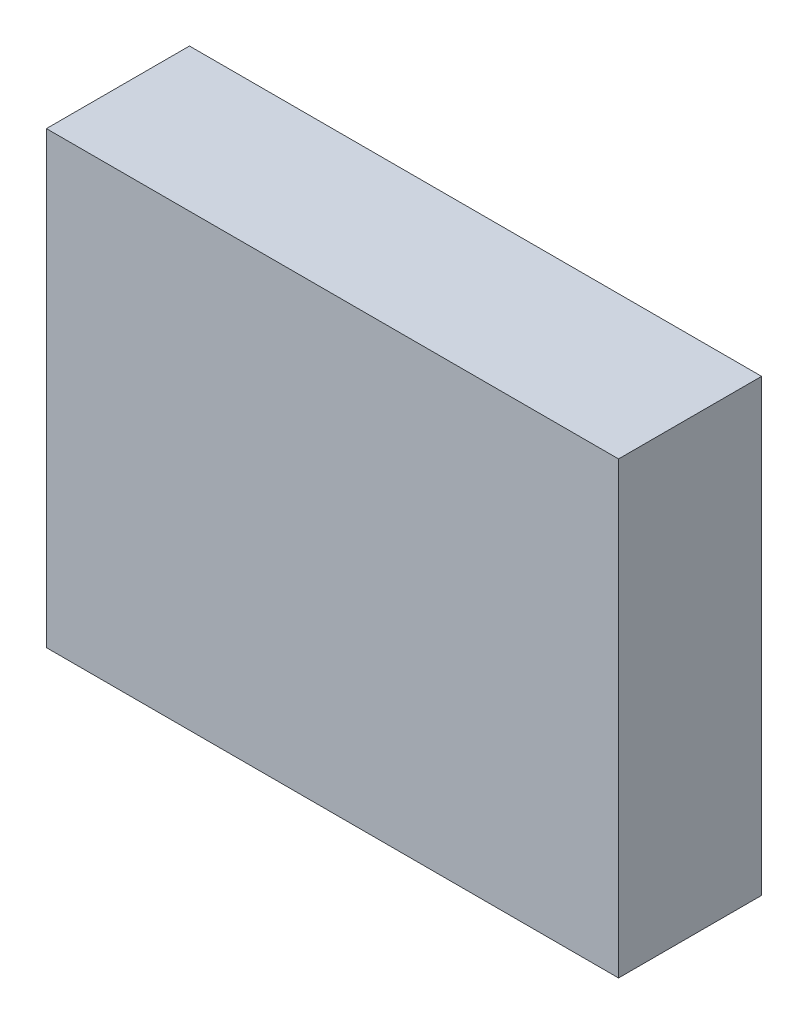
ISO-10303-21;
HEADER;
FILE_DESCRIPTION(('STEP AP214'),'2;1');
FILE_NAME('part.step','',(''),(''),'','','');
FILE_SCHEMA(('AUTOMOTIVE_DESIGN { 1 0 10303 214 1 1 1 1 }'));
ENDSEC;
DATA;
#1=APPLICATION_CONTEXT('core data for automotive mechanical design processes');
#2=APPLICATION_PROTOCOL_DEFINITION('international standard','automotive_design',2000,#1);
#3=PRODUCT_CONTEXT('',#1,'mechanical');
#4=PRODUCT('Part','Part','',(#3));
#5=PRODUCT_RELATED_PRODUCT_CATEGORY('part','',(#4));
#6=PRODUCT_DEFINITION_FORMATION('','',#4);
#7=PRODUCT_DEFINITION_CONTEXT('part definition',#1,'design');
#8=PRODUCT_DEFINITION('design','',#6,#7);
#9=PRODUCT_DEFINITION_SHAPE('','',#8);
#10=(LENGTH_UNIT() NAMED_UNIT(*) SI_UNIT(.MILLI.,.METRE.));
#11=(NAMED_UNIT(*) PLANE_ANGLE_UNIT() SI_UNIT($,.RADIAN.));
#12=(NAMED_UNIT(*) SI_UNIT($,.STERADIAN.) SOLID_ANGLE_UNIT());
#13=UNCERTAINTY_MEASURE_WITH_UNIT(LENGTH_MEASURE(1.E-05),#10,'distance_accuracy_value','');
#14=(GEOMETRIC_REPRESENTATION_CONTEXT(3) GLOBAL_UNCERTAINTY_ASSIGNED_CONTEXT((#13)) GLOBAL_UNIT_ASSIGNED_CONTEXT((#10,
#11,#12)) REPRESENTATION_CONTEXT('',''));
#15=CARTESIAN_POINT('',(0.,0.,0.));
#16=DIRECTION('',(0.,0.,1.));
#17=DIRECTION('',(1.,0.,0.));
#18=AXIS2_PLACEMENT_3D('',#15,#16,#17);
#19=CARTESIAN_POINT('',(0.,0.,0.0762));
#20=DIRECTION('',(0.,0.,1.));
#21=DIRECTION('',(1.,0.,0.));
#22=AXIS2_PLACEMENT_3D('',#19,#20,#21);
#23=PLANE('',#22);
#24=DIRECTION('',(1.,0.,0.));
#25=VECTOR('',#24,1.);
#26=CARTESIAN_POINT('',(-0.64999999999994,-0.18800000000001,0.0762));
#27=LINE('',#26,#25);
#28=CARTESIAN_POINT('',(-0.64999999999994,-0.18800000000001,0.0762));
#29=VERTEX_POINT('',#28);
#30=CARTESIAN_POINT('',(-0.350000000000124,-0.18800000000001,0.0762));
#31=VERTEX_POINT('',#30);
#32=EDGE_CURVE('E294',#29,#31,#27,.T.);
#33=ORIENTED_EDGE('',*,*,#32,.F.);
#34=DIRECTION('',(0.,1.,0.));
#35=VECTOR('',#34,1.);
#36=CARTESIAN_POINT('',(-0.64999999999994,0.18800000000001,0.0762));
#37=LINE('',#36,#35);
#38=CARTESIAN_POINT('',(-0.64999999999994,0.18800000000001,0.0762));
#39=VERTEX_POINT('',#38);
#40=EDGE_CURVE('E19',#39,#29,#37,.F.);
#41=ORIENTED_EDGE('',*,*,#40,.F.);
#42=DIRECTION('',(1.,0.,0.));
#43=VECTOR('',#42,1.);
#44=CARTESIAN_POINT('',(-0.350000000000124,0.18800000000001,0.0762));
#45=LINE('',#44,#43);
#46=CARTESIAN_POINT('',(-0.350000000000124,0.18800000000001,0.0762));
#47=VERTEX_POINT('',#46);
#48=EDGE_CURVE('E322',#47,#39,#45,.F.);
#49=ORIENTED_EDGE('',*,*,#48,.F.);
#50=DIRECTION('',(0.,1.,0.));
#51=VECTOR('',#50,1.);
#52=CARTESIAN_POINT('',(-0.350000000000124,-0.18800000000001,0.0762));
#53=LINE('',#52,#51);
#54=EDGE_CURVE('E307',#31,#47,#53,.T.);
#55=ORIENTED_EDGE('',*,*,#54,.F.);
#56=EDGE_LOOP('',(#33,#41,#49,#55));
#57=FACE_BOUND('',#56,.T.);
#58=ADVANCED_FACE('F16',(#57),#23,.F.);
#59=CARTESIAN_POINT('',(0.,0.,0.0762));
#60=DIRECTION('',(0.,0.,1.));
#61=DIRECTION('',(1.,0.,0.));
#62=AXIS2_PLACEMENT_3D('',#59,#60,#61);
#63=PLANE('',#62);
#64=DIRECTION('',(0.,1.,0.));
#65=VECTOR('',#64,1.);
#66=CARTESIAN_POINT('',(0.15000000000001,0.100000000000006,0.0762));
#67=LINE('',#66,#65);
#68=CARTESIAN_POINT('',(0.15000000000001,0.100000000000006,0.0762));
#69=VERTEX_POINT('',#68);
#70=CARTESIAN_POINT('',(0.15000000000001,0.475999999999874,0.0762));
#71=VERTEX_POINT('',#70);
#72=EDGE_CURVE('E329',#69,#71,#67,.T.);
#73=ORIENTED_EDGE('',*,*,#72,.F.);
#74=DIRECTION('',(1.,0.,0.));
#75=VECTOR('',#74,1.);
#76=CARTESIAN_POINT('',(-0.15000000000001,0.100000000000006,0.0762));
#77=LINE('',#76,#75);
#78=CARTESIAN_POINT('',(-0.15000000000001,0.100000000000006,0.0762));
#79=VERTEX_POINT('',#78);
#80=EDGE_CURVE('E324',#79,#69,#77,.T.);
#81=ORIENTED_EDGE('',*,*,#80,.F.);
#82=DIRECTION('',(0.,1.,0.));
#83=VECTOR('',#82,1.);
#84=CARTESIAN_POINT('',(-0.15000000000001,0.475999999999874,0.0762));
#85=LINE('',#84,#83);
#86=CARTESIAN_POINT('',(-0.15000000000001,0.475999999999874,0.0762));
#87=VERTEX_POINT('',#86);
#88=EDGE_CURVE('E342',#87,#79,#85,.F.);
#89=ORIENTED_EDGE('',*,*,#88,.F.);
#90=DIRECTION('',(1.,0.,0.));
#91=VECTOR('',#90,1.);
#92=CARTESIAN_POINT('',(0.15000000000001,0.475999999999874,0.0762));
#93=LINE('',#92,#91);
#94=EDGE_CURVE('E334',#71,#87,#93,.F.);
#95=ORIENTED_EDGE('',*,*,#94,.F.);
#96=EDGE_LOOP('',(#73,#81,#89,#95));
#97=FACE_BOUND('',#96,.T.);
#98=ADVANCED_FACE('F1187',(#97),#63,.F.);
#99=CARTESIAN_POINT('',(0.,0.,0.0762));
#100=DIRECTION('',(0.,0.,1.));
#101=DIRECTION('',(1.,0.,0.));
#102=AXIS2_PLACEMENT_3D('',#99,#100,#101);
#103=PLANE('',#102);
#104=DIRECTION('',(1.,0.,0.));
#105=VECTOR('',#104,1.);
#106=CARTESIAN_POINT('',(0.64999999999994,0.475999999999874,0.0762));
#107=LINE('',#106,#105);
#108=CARTESIAN_POINT('',(0.64999999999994,0.475999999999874,0.0762));
#109=VERTEX_POINT('',#108);
#110=CARTESIAN_POINT('',(0.350000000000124,0.475999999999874,0.0762));
#111=VERTEX_POINT('',#110);
#112=EDGE_CURVE('E350',#109,#111,#107,.F.);
#113=ORIENTED_EDGE('',*,*,#112,.F.);
#114=DIRECTION('',(0.,1.,0.));
#115=VECTOR('',#114,1.);
#116=CARTESIAN_POINT('',(0.64999999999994,0.100000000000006,0.0762));
#117=LINE('',#116,#115);
#118=CARTESIAN_POINT('',(0.64999999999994,0.100000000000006,0.0762));
#119=VERTEX_POINT('',#118);
#120=EDGE_CURVE('E345',#119,#109,#117,.T.);
#121=ORIENTED_EDGE('',*,*,#120,.F.);
#122=DIRECTION('',(1.,0.,0.));
#123=VECTOR('',#122,1.);
#124=CARTESIAN_POINT('',(0.350000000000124,0.100000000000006,0.0762));
#125=LINE('',#124,#123);
#126=CARTESIAN_POINT('',(0.350000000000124,0.100000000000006,0.0762));
#127=VERTEX_POINT('',#126);
#128=EDGE_CURVE('E363',#127,#119,#125,.T.);
#129=ORIENTED_EDGE('',*,*,#128,.F.);
#130=DIRECTION('',(0.,1.,0.));
#131=VECTOR('',#130,1.);
#132=CARTESIAN_POINT('',(0.350000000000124,0.475999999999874,0.0762));
#133=LINE('',#132,#131);
#134=EDGE_CURVE('E355',#111,#127,#133,.F.);
#135=ORIENTED_EDGE('',*,*,#134,.F.);
#136=EDGE_LOOP('',(#113,#121,#129,#135));
#137=FACE_BOUND('',#136,.T.);
#138=ADVANCED_FACE('F1177',(#137),#103,.F.);
#139=CARTESIAN_POINT('',(0.,0.,0.0762));
#140=DIRECTION('',(0.,0.,1.));
#141=DIRECTION('',(1.,0.,0.));
#142=AXIS2_PLACEMENT_3D('',#139,#140,#141);
#143=PLANE('',#142);
#144=DIRECTION('',(0.,1.,0.));
#145=VECTOR('',#144,1.);
#146=CARTESIAN_POINT('',(-0.15000000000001,-0.100000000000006,0.0762));
#147=LINE('',#146,#145);
#148=CARTESIAN_POINT('',(-0.15000000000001,-0.100000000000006,0.0762));
#149=VERTEX_POINT('',#148);
#150=CARTESIAN_POINT('',(-0.15000000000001,-0.475999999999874,0.0762));
#151=VERTEX_POINT('',#150);
#152=EDGE_CURVE('E371',#149,#151,#147,.F.);
#153=ORIENTED_EDGE('',*,*,#152,.F.);
#154=DIRECTION('',(1.,0.,0.));
#155=VECTOR('',#154,1.);
#156=CARTESIAN_POINT('',(0.15000000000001,-0.100000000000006,0.0762));
#157=LINE('',#156,#155);
#158=CARTESIAN_POINT('',(0.15000000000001,-0.100000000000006,0.0762));
#159=VERTEX_POINT('',#158);
#160=EDGE_CURVE('E366',#159,#149,#157,.F.);
#161=ORIENTED_EDGE('',*,*,#160,.F.);
#162=DIRECTION('',(0.,1.,0.));
#163=VECTOR('',#162,1.);
#164=CARTESIAN_POINT('',(0.15000000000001,-0.475999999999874,0.0762));
#165=LINE('',#164,#163);
#166=CARTESIAN_POINT('',(0.15000000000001,-0.475999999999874,0.0762));
#167=VERTEX_POINT('',#166);
#168=EDGE_CURVE('E384',#167,#159,#165,.T.);
#169=ORIENTED_EDGE('',*,*,#168,.F.);
#170=DIRECTION('',(1.,0.,0.));
#171=VECTOR('',#170,1.);
#172=CARTESIAN_POINT('',(-0.15000000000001,-0.475999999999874,0.0762));
#173=LINE('',#172,#171);
#174=EDGE_CURVE('E376',#151,#167,#173,.T.);
#175=ORIENTED_EDGE('',*,*,#174,.F.);
#176=EDGE_LOOP('',(#153,#161,#169,#175));
#177=FACE_BOUND('',#176,.T.);
#178=ADVANCED_FACE('F1167',(#177),#143,.F.);
#179=CARTESIAN_POINT('',(0.,0.,0.0762));
#180=DIRECTION('',(0.,0.,1.));
#181=DIRECTION('',(1.,0.,0.));
#182=AXIS2_PLACEMENT_3D('',#179,#180,#181);
#183=PLANE('',#182);
#184=DIRECTION('',(1.,0.,0.));
#185=VECTOR('',#184,1.);
#186=CARTESIAN_POINT('',(0.350000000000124,-0.475999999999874,0.0762));
#187=LINE('',#186,#185);
#188=CARTESIAN_POINT('',(0.350000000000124,-0.475999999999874,0.0762));
#189=VERTEX_POINT('',#188);
#190=CARTESIAN_POINT('',(0.64999999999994,-0.475999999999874,0.0762));
#191=VERTEX_POINT('',#190);
#192=EDGE_CURVE('E392',#189,#191,#187,.T.);
#193=ORIENTED_EDGE('',*,*,#192,.F.);
#194=DIRECTION('',(0.,1.,0.));
#195=VECTOR('',#194,1.);
#196=CARTESIAN_POINT('',(0.350000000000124,-0.100000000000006,0.0762));
#197=LINE('',#196,#195);
#198=CARTESIAN_POINT('',(0.350000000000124,-0.100000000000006,0.0762));
#199=VERTEX_POINT('',#198);
#200=EDGE_CURVE('E387',#199,#189,#197,.F.);
#201=ORIENTED_EDGE('',*,*,#200,.F.);
#202=DIRECTION('',(1.,0.,0.));
#203=VECTOR('',#202,1.);
#204=CARTESIAN_POINT('',(0.64999999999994,-0.100000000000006,0.0762));
#205=LINE('',#204,#203);
#206=CARTESIAN_POINT('',(0.64999999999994,-0.100000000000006,0.0762));
#207=VERTEX_POINT('',#206);
#208=EDGE_CURVE('E405',#207,#199,#205,.F.);
#209=ORIENTED_EDGE('',*,*,#208,.F.);
#210=DIRECTION('',(0.,1.,0.));
#211=VECTOR('',#210,1.);
#212=CARTESIAN_POINT('',(0.64999999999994,-0.475999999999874,0.0762));
#213=LINE('',#212,#211);
#214=EDGE_CURVE('E397',#191,#207,#213,.T.);
#215=ORIENTED_EDGE('',*,*,#214,.F.);
#216=EDGE_LOOP('',(#193,#201,#209,#215));
#217=FACE_BOUND('',#216,.T.);
#218=ADVANCED_FACE('F1158',(#217),#183,.F.);
#219=CARTESIAN_POINT('',(-0.64999999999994,0.18800000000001,0.0762));
#220=DIRECTION('',(-1.,0.,0.));
#221=DIRECTION('',(0.,0.,1.));
#222=AXIS2_PLACEMENT_3D('',#219,#220,#221);
#223=PLANE('',#222);
#224=DIRECTION('',(0.,0.,1.));
#225=VECTOR('',#224,1.);
#226=CARTESIAN_POINT('',(-0.64999999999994,0.18800000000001,0.0762));
#227=LINE('',#226,#225);
#228=CARTESIAN_POINT('',(-0.64999999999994,0.18800000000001,0.0862000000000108));
#229=VERTEX_POINT('',#228);
#230=EDGE_CURVE('E303',#39,#229,#227,.T.);
#231=ORIENTED_EDGE('',*,*,#230,.F.);
#232=ORIENTED_EDGE('',*,*,#40,.T.);
#233=DIRECTION('',(0.,0.,-1.));
#234=VECTOR('',#233,1.);
#235=CARTESIAN_POINT('',(-0.64999999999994,-0.18800000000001,0.0762));
#236=LINE('',#235,#234);
#237=CARTESIAN_POINT('',(-0.64999999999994,-0.18800000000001,0.0862000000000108));
#238=VERTEX_POINT('',#237);
#239=EDGE_CURVE('E300',#238,#29,#236,.T.);
#240=ORIENTED_EDGE('',*,*,#239,.F.);
#241=DIRECTION('',(0.,1.,0.));
#242=VECTOR('',#241,1.);
#243=CARTESIAN_POINT('',(-0.64999999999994,0.,0.0862000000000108));
#244=LINE('',#243,#242);
#245=EDGE_CURVE('E408',#229,#238,#244,.F.);
#246=ORIENTED_EDGE('',*,*,#245,.F.);
#247=EDGE_LOOP('',(#231,#232,#240,#246));
#248=FACE_BOUND('',#247,.T.);
#249=ADVANCED_FACE('F299',(#248),#223,.T.);
#250=CARTESIAN_POINT('',(-0.64999999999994,-0.18800000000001,0.0762));
#251=DIRECTION('',(0.,-1.,0.));
#252=DIRECTION('',(0.,0.,-1.));
#253=AXIS2_PLACEMENT_3D('',#250,#251,#252);
#254=PLANE('',#253);
#255=ORIENTED_EDGE('',*,*,#239,.T.);
#256=ORIENTED_EDGE('',*,*,#32,.T.);
#257=DIRECTION('',(0.,0.,-1.));
#258=VECTOR('',#257,1.);
#259=CARTESIAN_POINT('',(-0.350000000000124,-0.18800000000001,0.0762));
#260=LINE('',#259,#258);
#261=CARTESIAN_POINT('',(-0.350000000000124,-0.18800000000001,0.0862000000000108));
#262=VERTEX_POINT('',#261);
#263=EDGE_CURVE('E309',#262,#31,#260,.T.);
#264=ORIENTED_EDGE('',*,*,#263,.F.);
#265=DIRECTION('',(1.,0.,0.));
#266=VECTOR('',#265,1.);
#267=CARTESIAN_POINT('',(0.,-0.18800000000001,0.0862000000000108));
#268=LINE('',#267,#266);
#269=EDGE_CURVE('E313',#238,#262,#268,.T.);
#270=ORIENTED_EDGE('',*,*,#269,.F.);
#271=EDGE_LOOP('',(#255,#256,#264,#270));
#272=FACE_BOUND('',#271,.T.);
#273=ADVANCED_FACE('F311',(#272),#254,.T.);
#274=CARTESIAN_POINT('',(-0.350000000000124,-0.18800000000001,0.0762));
#275=DIRECTION('',(1.,0.,0.));
#276=DIRECTION('',(0.,0.,-1.));
#277=AXIS2_PLACEMENT_3D('',#274,#275,#276);
#278=PLANE('',#277);
#279=ORIENTED_EDGE('',*,*,#263,.T.);
#280=ORIENTED_EDGE('',*,*,#54,.T.);
#281=DIRECTION('',(0.,0.,1.));
#282=VECTOR('',#281,1.);
#283=CARTESIAN_POINT('',(-0.350000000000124,0.18800000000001,0.0762));
#284=LINE('',#283,#282);
#285=CARTESIAN_POINT('',(-0.350000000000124,0.18800000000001,0.0862000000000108));
#286=VERTEX_POINT('',#285);
#287=EDGE_CURVE('E319',#286,#47,#284,.F.);
#288=ORIENTED_EDGE('',*,*,#287,.F.);
#289=DIRECTION('',(0.,1.,0.));
#290=VECTOR('',#289,1.);
#291=CARTESIAN_POINT('',(-0.350000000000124,0.,0.0862000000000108));
#292=LINE('',#291,#290);
#293=EDGE_CURVE('E411',#262,#286,#292,.T.);
#294=ORIENTED_EDGE('',*,*,#293,.F.);
#295=EDGE_LOOP('',(#279,#280,#288,#294));
#296=FACE_BOUND('',#295,.T.);
#297=ADVANCED_FACE('F1132',(#296),#278,.T.);
#298=CARTESIAN_POINT('',(-0.350000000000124,0.18800000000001,0.0762));
#299=DIRECTION('',(0.,1.,0.));
#300=DIRECTION('',(0.,0.,1.));
#301=AXIS2_PLACEMENT_3D('',#298,#299,#300);
#302=PLANE('',#301);
#303=ORIENTED_EDGE('',*,*,#287,.T.);
#304=ORIENTED_EDGE('',*,*,#48,.T.);
#305=ORIENTED_EDGE('',*,*,#230,.T.);
#306=DIRECTION('',(1.,0.,0.));
#307=VECTOR('',#306,1.);
#308=CARTESIAN_POINT('',(0.,0.18800000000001,0.0862000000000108));
#309=LINE('',#308,#307);
#310=EDGE_CURVE('E414',#286,#229,#309,.F.);
#311=ORIENTED_EDGE('',*,*,#310,.F.);
#312=EDGE_LOOP('',(#303,#304,#305,#311));
#313=FACE_BOUND('',#312,.T.);
#314=ADVANCED_FACE('F1123',(#313),#302,.T.);
#315=CARTESIAN_POINT('',(-0.15000000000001,0.100000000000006,0.0762));
#316=DIRECTION('',(0.,-1.,0.));
#317=DIRECTION('',(0.,0.,-1.));
#318=AXIS2_PLACEMENT_3D('',#315,#316,#317);
#319=PLANE('',#318);
#320=DIRECTION('',(0.,0.,1.));
#321=VECTOR('',#320,1.);
#322=CARTESIAN_POINT('',(-0.15000000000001,0.100000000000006,0.0762));
#323=LINE('',#322,#321);
#324=CARTESIAN_POINT('',(-0.15000000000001,0.100000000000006,0.0862000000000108));
#325=VERTEX_POINT('',#324);
#326=EDGE_CURVE('E336',#79,#325,#323,.T.);
#327=ORIENTED_EDGE('',*,*,#326,.F.);
#328=ORIENTED_EDGE('',*,*,#80,.T.);
#329=DIRECTION('',(0.,0.,-1.));
#330=VECTOR('',#329,1.);
#331=CARTESIAN_POINT('',(0.15000000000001,0.100000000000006,0.0762));
#332=LINE('',#331,#330);
#333=CARTESIAN_POINT('',(0.15000000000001,0.100000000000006,0.0862000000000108));
#334=VERTEX_POINT('',#333);
#335=EDGE_CURVE('E326',#334,#69,#332,.T.);
#336=ORIENTED_EDGE('',*,*,#335,.F.);
#337=DIRECTION('',(1.,0.,0.));
#338=VECTOR('',#337,1.);
#339=CARTESIAN_POINT('',(0.,0.100000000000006,0.0862000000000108));
#340=LINE('',#339,#338);
#341=EDGE_CURVE('E417',#325,#334,#340,.T.);
#342=ORIENTED_EDGE('',*,*,#341,.F.);
#343=EDGE_LOOP('',(#327,#328,#336,#342));
#344=FACE_BOUND('',#343,.T.);
#345=ADVANCED_FACE('F1112',(#344),#319,.T.);
#346=CARTESIAN_POINT('',(0.15000000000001,0.100000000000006,0.0762));
#347=DIRECTION('',(1.,0.,0.));
#348=DIRECTION('',(0.,0.,-1.));
#349=AXIS2_PLACEMENT_3D('',#346,#347,#348);
#350=PLANE('',#349);
#351=ORIENTED_EDGE('',*,*,#335,.T.);
#352=ORIENTED_EDGE('',*,*,#72,.T.);
#353=DIRECTION('',(0.,0.,1.));
#354=VECTOR('',#353,1.);
#355=CARTESIAN_POINT('',(0.15000000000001,0.475999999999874,0.0762));
#356=LINE('',#355,#354);
#357=CARTESIAN_POINT('',(0.15000000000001,0.475999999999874,0.0862000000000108));
#358=VERTEX_POINT('',#357);
#359=EDGE_CURVE('E331',#358,#71,#356,.F.);
#360=ORIENTED_EDGE('',*,*,#359,.F.);
#361=DIRECTION('',(0.,1.,0.));
#362=VECTOR('',#361,1.);
#363=CARTESIAN_POINT('',(0.15000000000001,0.,0.0862000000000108));
#364=LINE('',#363,#362);
#365=EDGE_CURVE('E420',#334,#358,#364,.T.);
#366=ORIENTED_EDGE('',*,*,#365,.F.);
#367=EDGE_LOOP('',(#351,#352,#360,#366));
#368=FACE_BOUND('',#367,.T.);
#369=ADVANCED_FACE('F1102',(#368),#350,.T.);
#370=CARTESIAN_POINT('',(0.15000000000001,0.475999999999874,0.0762));
#371=DIRECTION('',(0.,1.,0.));
#372=DIRECTION('',(0.,0.,1.));
#373=AXIS2_PLACEMENT_3D('',#370,#371,#372);
#374=PLANE('',#373);
#375=ORIENTED_EDGE('',*,*,#359,.T.);
#376=ORIENTED_EDGE('',*,*,#94,.T.);
#377=DIRECTION('',(0.,0.,1.));
#378=VECTOR('',#377,1.);
#379=CARTESIAN_POINT('',(-0.15000000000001,0.475999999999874,0.0762));
#380=LINE('',#379,#378);
#381=CARTESIAN_POINT('',(-0.15000000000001,0.475999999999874,0.0862000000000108));
#382=VERTEX_POINT('',#381);
#383=EDGE_CURVE('E339',#382,#87,#380,.F.);
#384=ORIENTED_EDGE('',*,*,#383,.F.);
#385=DIRECTION('',(1.,0.,0.));
#386=VECTOR('',#385,1.);
#387=CARTESIAN_POINT('',(0.,0.475999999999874,0.0862000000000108));
#388=LINE('',#387,#386);
#389=EDGE_CURVE('E423',#358,#382,#388,.F.);
#390=ORIENTED_EDGE('',*,*,#389,.F.);
#391=EDGE_LOOP('',(#375,#376,#384,#390));
#392=FACE_BOUND('',#391,.T.);
#393=ADVANCED_FACE('F1092',(#392),#374,.T.);
#394=CARTESIAN_POINT('',(-0.15000000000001,0.475999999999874,0.0762));
#395=DIRECTION('',(-1.,0.,0.));
#396=DIRECTION('',(0.,0.,1.));
#397=AXIS2_PLACEMENT_3D('',#394,#395,#396);
#398=PLANE('',#397);
#399=ORIENTED_EDGE('',*,*,#383,.T.);
#400=ORIENTED_EDGE('',*,*,#88,.T.);
#401=ORIENTED_EDGE('',*,*,#326,.T.);
#402=DIRECTION('',(0.,1.,0.));
#403=VECTOR('',#402,1.);
#404=CARTESIAN_POINT('',(-0.15000000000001,0.,0.0862000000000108));
#405=LINE('',#404,#403);
#406=EDGE_CURVE('E426',#382,#325,#405,.F.);
#407=ORIENTED_EDGE('',*,*,#406,.F.);
#408=EDGE_LOOP('',(#399,#400,#401,#407));
#409=FACE_BOUND('',#408,.T.);
#410=ADVANCED_FACE('F1082',(#409),#398,.T.);
#411=CARTESIAN_POINT('',(0.64999999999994,0.100000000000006,0.0762));
#412=DIRECTION('',(1.,0.,0.));
#413=DIRECTION('',(0.,0.,-1.));
#414=AXIS2_PLACEMENT_3D('',#411,#412,#413);
#415=PLANE('',#414);
#416=DIRECTION('',(0.,0.,-1.));
#417=VECTOR('',#416,1.);
#418=CARTESIAN_POINT('',(0.64999999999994,0.100000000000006,0.0762));
#419=LINE('',#418,#417);
#420=CARTESIAN_POINT('',(0.64999999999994,0.100000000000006,0.0862000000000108));
#421=VERTEX_POINT('',#420);
#422=EDGE_CURVE('E357',#119,#421,#419,.F.);
#423=ORIENTED_EDGE('',*,*,#422,.F.);
#424=ORIENTED_EDGE('',*,*,#120,.T.);
#425=DIRECTION('',(0.,0.,1.));
#426=VECTOR('',#425,1.);
#427=CARTESIAN_POINT('',(0.64999999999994,0.475999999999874,0.0762));
#428=LINE('',#427,#426);
#429=CARTESIAN_POINT('',(0.64999999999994,0.475999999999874,0.0862000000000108));
#430=VERTEX_POINT('',#429);
#431=EDGE_CURVE('E347',#430,#109,#428,.F.);
#432=ORIENTED_EDGE('',*,*,#431,.F.);
#433=DIRECTION('',(0.,1.,0.));
#434=VECTOR('',#433,1.);
#435=CARTESIAN_POINT('',(0.64999999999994,0.,0.0862000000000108));
#436=LINE('',#435,#434);
#437=EDGE_CURVE('E429',#421,#430,#436,.T.);
#438=ORIENTED_EDGE('',*,*,#437,.F.);
#439=EDGE_LOOP('',(#423,#424,#432,#438));
#440=FACE_BOUND('',#439,.T.);
#441=ADVANCED_FACE('F1072',(#440),#415,.T.);
#442=CARTESIAN_POINT('',(0.64999999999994,0.475999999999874,0.0762));
#443=DIRECTION('',(0.,1.,0.));
#444=DIRECTION('',(0.,0.,1.));
#445=AXIS2_PLACEMENT_3D('',#442,#443,#444);
#446=PLANE('',#445);
#447=ORIENTED_EDGE('',*,*,#431,.T.);
#448=ORIENTED_EDGE('',*,*,#112,.T.);
#449=DIRECTION('',(0.,0.,1.));
#450=VECTOR('',#449,1.);
#451=CARTESIAN_POINT('',(0.350000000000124,0.475999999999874,0.0762));
#452=LINE('',#451,#450);
#453=CARTESIAN_POINT('',(0.350000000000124,0.475999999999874,0.0862000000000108));
#454=VERTEX_POINT('',#453);
#455=EDGE_CURVE('E352',#454,#111,#452,.F.);
#456=ORIENTED_EDGE('',*,*,#455,.F.);
#457=DIRECTION('',(1.,0.,0.));
#458=VECTOR('',#457,1.);
#459=CARTESIAN_POINT('',(0.,0.475999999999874,0.0862000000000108));
#460=LINE('',#459,#458);
#461=EDGE_CURVE('E432',#430,#454,#460,.F.);
#462=ORIENTED_EDGE('',*,*,#461,.F.);
#463=EDGE_LOOP('',(#447,#448,#456,#462));
#464=FACE_BOUND('',#463,.T.);
#465=ADVANCED_FACE('F1062',(#464),#446,.T.);
#466=CARTESIAN_POINT('',(0.350000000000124,0.475999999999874,0.0762));
#467=DIRECTION('',(-1.,0.,0.));
#468=DIRECTION('',(0.,0.,1.));
#469=AXIS2_PLACEMENT_3D('',#466,#467,#468);
#470=PLANE('',#469);
#471=ORIENTED_EDGE('',*,*,#455,.T.);
#472=ORIENTED_EDGE('',*,*,#134,.T.);
#473=DIRECTION('',(0.,0.,-1.));
#474=VECTOR('',#473,1.);
#475=CARTESIAN_POINT('',(0.350000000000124,0.100000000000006,0.0762));
#476=LINE('',#475,#474);
#477=CARTESIAN_POINT('',(0.350000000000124,0.100000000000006,0.0862000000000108));
#478=VERTEX_POINT('',#477);
#479=EDGE_CURVE('E360',#478,#127,#476,.T.);
#480=ORIENTED_EDGE('',*,*,#479,.F.);
#481=DIRECTION('',(0.,1.,0.));
#482=VECTOR('',#481,1.);
#483=CARTESIAN_POINT('',(0.350000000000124,0.,0.0862000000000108));
#484=LINE('',#483,#482);
#485=EDGE_CURVE('E435',#454,#478,#484,.F.);
#486=ORIENTED_EDGE('',*,*,#485,.F.);
#487=EDGE_LOOP('',(#471,#472,#480,#486));
#488=FACE_BOUND('',#487,.T.);
#489=ADVANCED_FACE('F1052',(#488),#470,.T.);
#490=CARTESIAN_POINT('',(0.350000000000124,0.100000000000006,0.0762));
#491=DIRECTION('',(0.,-1.,0.));
#492=DIRECTION('',(0.,0.,-1.));
#493=AXIS2_PLACEMENT_3D('',#490,#491,#492);
#494=PLANE('',#493);
#495=ORIENTED_EDGE('',*,*,#479,.T.);
#496=ORIENTED_EDGE('',*,*,#128,.T.);
#497=ORIENTED_EDGE('',*,*,#422,.T.);
#498=DIRECTION('',(1.,0.,0.));
#499=VECTOR('',#498,1.);
#500=CARTESIAN_POINT('',(0.,0.100000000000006,0.0862000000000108));
#501=LINE('',#500,#499);
#502=EDGE_CURVE('E438',#478,#421,#501,.T.);
#503=ORIENTED_EDGE('',*,*,#502,.F.);
#504=EDGE_LOOP('',(#495,#496,#497,#503));
#505=FACE_BOUND('',#504,.T.);
#506=ADVANCED_FACE('F1042',(#505),#494,.T.);
#507=CARTESIAN_POINT('',(0.15000000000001,-0.100000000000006,0.0762));
#508=DIRECTION('',(0.,1.,0.));
#509=DIRECTION('',(0.,0.,1.));
#510=AXIS2_PLACEMENT_3D('',#507,#508,#509);
#511=PLANE('',#510);
#512=DIRECTION('',(0.,0.,-1.));
#513=VECTOR('',#512,1.);
#514=CARTESIAN_POINT('',(0.15000000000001,-0.100000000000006,0.0762));
#515=LINE('',#514,#513);
#516=CARTESIAN_POINT('',(0.15000000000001,-0.100000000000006,0.0862000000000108));
#517=VERTEX_POINT('',#516);
#518=EDGE_CURVE('E378',#159,#517,#515,.F.);
#519=ORIENTED_EDGE('',*,*,#518,.F.);
#520=ORIENTED_EDGE('',*,*,#160,.T.);
#521=DIRECTION('',(0.,0.,1.));
#522=VECTOR('',#521,1.);
#523=CARTESIAN_POINT('',(-0.15000000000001,-0.100000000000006,0.0762));
#524=LINE('',#523,#522);
#525=CARTESIAN_POINT('',(-0.15000000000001,-0.100000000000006,0.0862000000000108));
#526=VERTEX_POINT('',#525);
#527=EDGE_CURVE('E368',#526,#149,#524,.F.);
#528=ORIENTED_EDGE('',*,*,#527,.F.);
#529=DIRECTION('',(1.,0.,0.));
#530=VECTOR('',#529,1.);
#531=CARTESIAN_POINT('',(0.,-0.100000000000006,0.0862000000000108));
#532=LINE('',#531,#530);
#533=EDGE_CURVE('E441',#517,#526,#532,.F.);
#534=ORIENTED_EDGE('',*,*,#533,.F.);
#535=EDGE_LOOP('',(#519,#520,#528,#534));
#536=FACE_BOUND('',#535,.T.);
#537=ADVANCED_FACE('F1032',(#536),#511,.T.);
#538=CARTESIAN_POINT('',(-0.15000000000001,-0.100000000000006,0.0762));
#539=DIRECTION('',(-1.,0.,0.));
#540=DIRECTION('',(0.,0.,1.));
#541=AXIS2_PLACEMENT_3D('',#538,#539,#540);
#542=PLANE('',#541);
#543=ORIENTED_EDGE('',*,*,#527,.T.);
#544=ORIENTED_EDGE('',*,*,#152,.T.);
#545=DIRECTION('',(0.,0.,-1.));
#546=VECTOR('',#545,1.);
#547=CARTESIAN_POINT('',(-0.15000000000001,-0.475999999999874,0.0762));
#548=LINE('',#547,#546);
#549=CARTESIAN_POINT('',(-0.15000000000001,-0.475999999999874,0.0862000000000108));
#550=VERTEX_POINT('',#549);
#551=EDGE_CURVE('E373',#550,#151,#548,.T.);
#552=ORIENTED_EDGE('',*,*,#551,.F.);
#553=DIRECTION('',(0.,1.,0.));
#554=VECTOR('',#553,1.);
#555=CARTESIAN_POINT('',(-0.15000000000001,0.,0.0862000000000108));
#556=LINE('',#555,#554);
#557=EDGE_CURVE('E444',#526,#550,#556,.F.);
#558=ORIENTED_EDGE('',*,*,#557,.F.);
#559=EDGE_LOOP('',(#543,#544,#552,#558));
#560=FACE_BOUND('',#559,.T.);
#561=ADVANCED_FACE('F1022',(#560),#542,.T.);
#562=CARTESIAN_POINT('',(-0.15000000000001,-0.475999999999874,0.0762));
#563=DIRECTION('',(0.,-1.,0.));
#564=DIRECTION('',(0.,0.,-1.));
#565=AXIS2_PLACEMENT_3D('',#562,#563,#564);
#566=PLANE('',#565);
#567=ORIENTED_EDGE('',*,*,#551,.T.);
#568=ORIENTED_EDGE('',*,*,#174,.T.);
#569=DIRECTION('',(0.,0.,-1.));
#570=VECTOR('',#569,1.);
#571=CARTESIAN_POINT('',(0.15000000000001,-0.475999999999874,0.0762));
#572=LINE('',#571,#570);
#573=CARTESIAN_POINT('',(0.15000000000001,-0.475999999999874,0.0862000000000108));
#574=VERTEX_POINT('',#573);
#575=EDGE_CURVE('E381',#574,#167,#572,.T.);
#576=ORIENTED_EDGE('',*,*,#575,.F.);
#577=DIRECTION('',(1.,0.,0.));
#578=VECTOR('',#577,1.);
#579=CARTESIAN_POINT('',(0.,-0.475999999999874,0.0862000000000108));
#580=LINE('',#579,#578);
#581=EDGE_CURVE('E447',#550,#574,#580,.T.);
#582=ORIENTED_EDGE('',*,*,#581,.F.);
#583=EDGE_LOOP('',(#567,#568,#576,#582));
#584=FACE_BOUND('',#583,.T.);
#585=ADVANCED_FACE('F1012',(#584),#566,.T.);
#586=CARTESIAN_POINT('',(0.15000000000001,-0.475999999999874,0.0762));
#587=DIRECTION('',(1.,0.,0.));
#588=DIRECTION('',(0.,0.,-1.));
#589=AXIS2_PLACEMENT_3D('',#586,#587,#588);
#590=PLANE('',#589);
#591=ORIENTED_EDGE('',*,*,#575,.T.);
#592=ORIENTED_EDGE('',*,*,#168,.T.);
#593=ORIENTED_EDGE('',*,*,#518,.T.);
#594=DIRECTION('',(0.,1.,0.));
#595=VECTOR('',#594,1.);
#596=CARTESIAN_POINT('',(0.15000000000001,0.,0.0862000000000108));
#597=LINE('',#596,#595);
#598=EDGE_CURVE('E450',#574,#517,#597,.T.);
#599=ORIENTED_EDGE('',*,*,#598,.F.);
#600=EDGE_LOOP('',(#591,#592,#593,#599));
#601=FACE_BOUND('',#600,.T.);
#602=ADVANCED_FACE('F1002',(#601),#590,.T.);
#603=CARTESIAN_POINT('',(0.350000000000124,-0.100000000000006,0.0762));
#604=DIRECTION('',(-1.,0.,0.));
#605=DIRECTION('',(0.,0.,1.));
#606=AXIS2_PLACEMENT_3D('',#603,#604,#605);
#607=PLANE('',#606);
#608=DIRECTION('',(0.,0.,1.));
#609=VECTOR('',#608,1.);
#610=CARTESIAN_POINT('',(0.350000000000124,-0.100000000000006,0.0762));
#611=LINE('',#610,#609);
#612=CARTESIAN_POINT('',(0.350000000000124,-0.100000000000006,0.0862000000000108));
#613=VERTEX_POINT('',#612);
#614=EDGE_CURVE('E399',#199,#613,#611,.T.);
#615=ORIENTED_EDGE('',*,*,#614,.F.);
#616=ORIENTED_EDGE('',*,*,#200,.T.);
#617=DIRECTION('',(0.,0.,-1.));
#618=VECTOR('',#617,1.);
#619=CARTESIAN_POINT('',(0.350000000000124,-0.475999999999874,0.0762));
#620=LINE('',#619,#618);
#621=CARTESIAN_POINT('',(0.350000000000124,-0.475999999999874,0.0862000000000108));
#622=VERTEX_POINT('',#621);
#623=EDGE_CURVE('E389',#622,#189,#620,.T.);
#624=ORIENTED_EDGE('',*,*,#623,.F.);
#625=DIRECTION('',(0.,1.,0.));
#626=VECTOR('',#625,1.);
#627=CARTESIAN_POINT('',(0.350000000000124,0.,0.0862000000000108));
#628=LINE('',#627,#626);
#629=EDGE_CURVE('E453',#613,#622,#628,.F.);
#630=ORIENTED_EDGE('',*,*,#629,.F.);
#631=EDGE_LOOP('',(#615,#616,#624,#630));
#632=FACE_BOUND('',#631,.T.);
#633=ADVANCED_FACE('F992',(#632),#607,.T.);
#634=CARTESIAN_POINT('',(0.350000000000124,-0.475999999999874,0.0762));
#635=DIRECTION('',(0.,-1.,0.));
#636=DIRECTION('',(0.,0.,-1.));
#637=AXIS2_PLACEMENT_3D('',#634,#635,#636);
#638=PLANE('',#637);
#639=ORIENTED_EDGE('',*,*,#623,.T.);
#640=ORIENTED_EDGE('',*,*,#192,.T.);
#641=DIRECTION('',(0.,0.,-1.));
#642=VECTOR('',#641,1.);
#643=CARTESIAN_POINT('',(0.64999999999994,-0.475999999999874,0.0762));
#644=LINE('',#643,#642);
#645=CARTESIAN_POINT('',(0.64999999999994,-0.475999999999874,0.0862000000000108));
#646=VERTEX_POINT('',#645);
#647=EDGE_CURVE('E394',#646,#191,#644,.T.);
#648=ORIENTED_EDGE('',*,*,#647,.F.);
#649=DIRECTION('',(1.,0.,0.));
#650=VECTOR('',#649,1.);
#651=CARTESIAN_POINT('',(0.,-0.475999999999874,0.0862000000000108));
#652=LINE('',#651,#650);
#653=EDGE_CURVE('E456',#622,#646,#652,.T.);
#654=ORIENTED_EDGE('',*,*,#653,.F.);
#655=EDGE_LOOP('',(#639,#640,#648,#654));
#656=FACE_BOUND('',#655,.T.);
#657=ADVANCED_FACE('F982',(#656),#638,.T.);
#658=CARTESIAN_POINT('',(0.64999999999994,-0.475999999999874,0.0762));
#659=DIRECTION('',(1.,0.,0.));
#660=DIRECTION('',(0.,0.,-1.));
#661=AXIS2_PLACEMENT_3D('',#658,#659,#660);
#662=PLANE('',#661);
#663=ORIENTED_EDGE('',*,*,#647,.T.);
#664=ORIENTED_EDGE('',*,*,#214,.T.);
#665=DIRECTION('',(0.,0.,1.));
#666=VECTOR('',#665,1.);
#667=CARTESIAN_POINT('',(0.64999999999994,-0.100000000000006,0.0762));
#668=LINE('',#667,#666);
#669=CARTESIAN_POINT('',(0.64999999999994,-0.100000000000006,0.0862000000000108));
#670=VERTEX_POINT('',#669);
#671=EDGE_CURVE('E402',#670,#207,#668,.F.);
#672=ORIENTED_EDGE('',*,*,#671,.F.);
#673=DIRECTION('',(0.,1.,0.));
#674=VECTOR('',#673,1.);
#675=CARTESIAN_POINT('',(0.64999999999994,0.,0.0862000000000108));
#676=LINE('',#675,#674);
#677=EDGE_CURVE('E459',#646,#670,#676,.T.);
#678=ORIENTED_EDGE('',*,*,#677,.F.);
#679=EDGE_LOOP('',(#663,#664,#672,#678));
#680=FACE_BOUND('',#679,.T.);
#681=ADVANCED_FACE('F972',(#680),#662,.T.);
#682=CARTESIAN_POINT('',(0.64999999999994,-0.100000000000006,0.0762));
#683=DIRECTION('',(0.,1.,0.));
#684=DIRECTION('',(0.,0.,1.));
#685=AXIS2_PLACEMENT_3D('',#682,#683,#684);
#686=PLANE('',#685);
#687=ORIENTED_EDGE('',*,*,#671,.T.);
#688=ORIENTED_EDGE('',*,*,#208,.T.);
#689=ORIENTED_EDGE('',*,*,#614,.T.);
#690=DIRECTION('',(1.,0.,0.));
#691=VECTOR('',#690,1.);
#692=CARTESIAN_POINT('',(0.,-0.100000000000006,0.0862000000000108));
#693=LINE('',#692,#691);
#694=EDGE_CURVE('E462',#670,#613,#693,.F.);
#695=ORIENTED_EDGE('',*,*,#694,.F.);
#696=EDGE_LOOP('',(#687,#688,#689,#695));
#697=FACE_BOUND('',#696,.T.);
#698=ADVANCED_FACE('F962',(#697),#686,.T.);
#699=CARTESIAN_POINT('',(0.,0.,0.0862000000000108));
#700=DIRECTION('',(0.,0.,1.));
#701=DIRECTION('',(1.,0.,0.));
#702=AXIS2_PLACEMENT_3D('',#699,#700,#701);
#703=PLANE('',#702);
#704=DIRECTION('',(1.,0.,0.));
#705=VECTOR('',#704,1.);
#706=CARTESIAN_POINT('',(-0.62500000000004,-0.16250000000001,0.0862000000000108));
#707=LINE('',#706,#705);
#708=CARTESIAN_POINT('',(-0.62500000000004,-0.16250000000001,0.0862000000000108));
#709=VERTEX_POINT('',#708);
#710=CARTESIAN_POINT('',(-0.375000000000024,-0.16250000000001,0.0862000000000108));
#711=VERTEX_POINT('',#710);
#712=EDGE_CURVE('E485',#709,#711,#707,.T.);
#713=ORIENTED_EDGE('',*,*,#712,.F.);
#714=DIRECTION('',(0.,1.,0.));
#715=VECTOR('',#714,1.);
#716=CARTESIAN_POINT('',(-0.62500000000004,0.16250000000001,0.0862000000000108));
#717=LINE('',#716,#715);
#718=CARTESIAN_POINT('',(-0.62500000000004,0.16250000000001,0.0862000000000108));
#719=VERTEX_POINT('',#718);
#720=EDGE_CURVE('E465',#719,#709,#717,.F.);
#721=ORIENTED_EDGE('',*,*,#720,.F.);
#722=DIRECTION('',(1.,0.,0.));
#723=VECTOR('',#722,1.);
#724=CARTESIAN_POINT('',(-0.375000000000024,0.16250000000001,0.0862000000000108));
#725=LINE('',#724,#723);
#726=CARTESIAN_POINT('',(-0.375000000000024,0.16250000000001,0.0862000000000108));
#727=VERTEX_POINT('',#726);
#728=EDGE_CURVE('E470',#727,#719,#725,.F.);
#729=ORIENTED_EDGE('',*,*,#728,.F.);
#730=DIRECTION('',(0.,1.,0.));
#731=VECTOR('',#730,1.);
#732=CARTESIAN_POINT('',(-0.375000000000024,-0.16250000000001,0.0862000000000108));
#733=LINE('',#732,#731);
#734=EDGE_CURVE('E476',#711,#727,#733,.T.);
#735=ORIENTED_EDGE('',*,*,#734,.F.);
#736=EDGE_LOOP('',(#713,#721,#729,#735));
#737=FACE_BOUND('',#736,.T.);
#738=ORIENTED_EDGE('',*,*,#293,.T.);
#739=ORIENTED_EDGE('',*,*,#310,.T.);
#740=ORIENTED_EDGE('',*,*,#245,.T.);
#741=ORIENTED_EDGE('',*,*,#269,.T.);
#742=EDGE_LOOP('',(#738,#739,#740,#741));
#743=FACE_BOUND('',#742,.T.);
#744=ADVANCED_FACE('F952',(#737,#743),#703,.T.);
#745=CARTESIAN_POINT('',(0.,0.,0.0862000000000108));
#746=DIRECTION('',(0.,0.,1.));
#747=DIRECTION('',(1.,0.,0.));
#748=AXIS2_PLACEMENT_3D('',#745,#746,#747);
#749=PLANE('',#748);
#750=DIRECTION('',(1.,0.,0.));
#751=VECTOR('',#750,1.);
#752=CARTESIAN_POINT('',(-0.125000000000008,0.125000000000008,0.0862000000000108));
#753=LINE('',#752,#751);
#754=CARTESIAN_POINT('',(-0.125000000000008,0.125000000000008,0.0862000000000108));
#755=VERTEX_POINT('',#754);
#756=CARTESIAN_POINT('',(0.125000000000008,0.125000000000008,0.0862000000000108));
#757=VERTEX_POINT('',#756);
#758=EDGE_CURVE('E508',#755,#757,#753,.T.);
#759=ORIENTED_EDGE('',*,*,#758,.F.);
#760=DIRECTION('',(0.,1.,0.));
#761=VECTOR('',#760,1.);
#762=CARTESIAN_POINT('',(-0.125000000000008,0.449999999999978,0.0862000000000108));
#763=LINE('',#762,#761);
#764=CARTESIAN_POINT('',(-0.125000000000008,0.449999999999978,0.0862000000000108));
#765=VERTEX_POINT('',#764);
#766=EDGE_CURVE('E488',#765,#755,#763,.F.);
#767=ORIENTED_EDGE('',*,*,#766,.F.);
#768=DIRECTION('',(1.,0.,0.));
#769=VECTOR('',#768,1.);
#770=CARTESIAN_POINT('',(0.125000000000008,0.449999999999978,0.0862000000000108));
#771=LINE('',#770,#769);
#772=CARTESIAN_POINT('',(0.125000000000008,0.449999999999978,0.0862000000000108));
#773=VERTEX_POINT('',#772);
#774=EDGE_CURVE('E493',#773,#765,#771,.F.);
#775=ORIENTED_EDGE('',*,*,#774,.F.);
#776=DIRECTION('',(0.,1.,0.));
#777=VECTOR('',#776,1.);
#778=CARTESIAN_POINT('',(0.125000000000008,0.125000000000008,0.0862000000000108));
#779=LINE('',#778,#777);
#780=EDGE_CURVE('E499',#757,#773,#779,.T.);
#781=ORIENTED_EDGE('',*,*,#780,.F.);
#782=EDGE_LOOP('',(#759,#767,#775,#781));
#783=FACE_BOUND('',#782,.T.);
#784=ORIENTED_EDGE('',*,*,#389,.T.);
#785=ORIENTED_EDGE('',*,*,#406,.T.);
#786=ORIENTED_EDGE('',*,*,#341,.T.);
#787=ORIENTED_EDGE('',*,*,#365,.T.);
#788=EDGE_LOOP('',(#784,#785,#786,#787));
#789=FACE_BOUND('',#788,.T.);
#790=ADVANCED_FACE('F942',(#783,#789),#749,.T.);
#791=CARTESIAN_POINT('',(0.,0.,0.0862000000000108));
#792=DIRECTION('',(0.,0.,1.));
#793=DIRECTION('',(1.,0.,0.));
#794=AXIS2_PLACEMENT_3D('',#791,#792,#793);
#795=PLANE('',#794);
#796=DIRECTION('',(1.,0.,0.));
#797=VECTOR('',#796,1.);
#798=CARTESIAN_POINT('',(0.375000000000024,0.125000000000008,0.0862000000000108));
#799=LINE('',#798,#797);
#800=CARTESIAN_POINT('',(0.375000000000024,0.125000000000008,0.0862000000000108));
#801=VERTEX_POINT('',#800);
#802=CARTESIAN_POINT('',(0.62500000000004,0.125000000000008,0.0862000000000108));
#803=VERTEX_POINT('',#802);
#804=EDGE_CURVE('E531',#801,#803,#799,.T.);
#805=ORIENTED_EDGE('',*,*,#804,.F.);
#806=DIRECTION('',(0.,1.,0.));
#807=VECTOR('',#806,1.);
#808=CARTESIAN_POINT('',(0.375000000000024,0.449999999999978,0.0862000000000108));
#809=LINE('',#808,#807);
#810=CARTESIAN_POINT('',(0.375000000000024,0.449999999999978,0.0862000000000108));
#811=VERTEX_POINT('',#810);
#812=EDGE_CURVE('E511',#811,#801,#809,.F.);
#813=ORIENTED_EDGE('',*,*,#812,.F.);
#814=DIRECTION('',(1.,0.,0.));
#815=VECTOR('',#814,1.);
#816=CARTESIAN_POINT('',(0.62500000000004,0.449999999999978,0.0862000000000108));
#817=LINE('',#816,#815);
#818=CARTESIAN_POINT('',(0.62500000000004,0.449999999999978,0.0862000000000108));
#819=VERTEX_POINT('',#818);
#820=EDGE_CURVE('E516',#819,#811,#817,.F.);
#821=ORIENTED_EDGE('',*,*,#820,.F.);
#822=DIRECTION('',(0.,1.,0.));
#823=VECTOR('',#822,1.);
#824=CARTESIAN_POINT('',(0.62500000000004,0.125000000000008,0.0862000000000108));
#825=LINE('',#824,#823);
#826=EDGE_CURVE('E522',#803,#819,#825,.T.);
#827=ORIENTED_EDGE('',*,*,#826,.F.);
#828=EDGE_LOOP('',(#805,#813,#821,#827));
#829=FACE_BOUND('',#828,.T.);
#830=ORIENTED_EDGE('',*,*,#485,.T.);
#831=ORIENTED_EDGE('',*,*,#502,.T.);
#832=ORIENTED_EDGE('',*,*,#437,.T.);
#833=ORIENTED_EDGE('',*,*,#461,.T.);
#834=EDGE_LOOP('',(#830,#831,#832,#833));
#835=FACE_BOUND('',#834,.T.);
#836=ADVANCED_FACE('F932',(#829,#835),#795,.T.);
#837=CARTESIAN_POINT('',(0.,0.,0.0862000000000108));
#838=DIRECTION('',(0.,0.,1.));
#839=DIRECTION('',(1.,0.,0.));
#840=AXIS2_PLACEMENT_3D('',#837,#838,#839);
#841=PLANE('',#840);
#842=DIRECTION('',(0.,1.,0.));
#843=VECTOR('',#842,1.);
#844=CARTESIAN_POINT('',(0.125000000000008,-0.449999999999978,0.0862000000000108));
#845=LINE('',#844,#843);
#846=CARTESIAN_POINT('',(0.125000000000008,-0.449999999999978,0.0862000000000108));
#847=VERTEX_POINT('',#846);
#848=CARTESIAN_POINT('',(0.125000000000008,-0.125000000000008,0.0862000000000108));
#849=VERTEX_POINT('',#848);
#850=EDGE_CURVE('E554',#847,#849,#845,.T.);
#851=ORIENTED_EDGE('',*,*,#850,.F.);
#852=DIRECTION('',(1.,0.,0.));
#853=VECTOR('',#852,1.);
#854=CARTESIAN_POINT('',(-0.125000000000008,-0.449999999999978,0.0862000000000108));
#855=LINE('',#854,#853);
#856=CARTESIAN_POINT('',(-0.125000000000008,-0.449999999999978,0.0862000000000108));
#857=VERTEX_POINT('',#856);
#858=EDGE_CURVE('E534',#857,#847,#855,.T.);
#859=ORIENTED_EDGE('',*,*,#858,.F.);
#860=DIRECTION('',(0.,1.,0.));
#861=VECTOR('',#860,1.);
#862=CARTESIAN_POINT('',(-0.125000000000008,-0.125000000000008,0.0862000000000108));
#863=LINE('',#862,#861);
#864=CARTESIAN_POINT('',(-0.125000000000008,-0.125000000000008,0.0862000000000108));
#865=VERTEX_POINT('',#864);
#866=EDGE_CURVE('E539',#865,#857,#863,.F.);
#867=ORIENTED_EDGE('',*,*,#866,.F.);
#868=DIRECTION('',(1.,0.,0.));
#869=VECTOR('',#868,1.);
#870=CARTESIAN_POINT('',(0.125000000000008,-0.125000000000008,0.0862000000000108));
#871=LINE('',#870,#869);
#872=EDGE_CURVE('E545',#849,#865,#871,.F.);
#873=ORIENTED_EDGE('',*,*,#872,.F.);
#874=EDGE_LOOP('',(#851,#859,#867,#873));
#875=FACE_BOUND('',#874,.T.);
#876=ORIENTED_EDGE('',*,*,#581,.T.);
#877=ORIENTED_EDGE('',*,*,#598,.T.);
#878=ORIENTED_EDGE('',*,*,#533,.T.);
#879=ORIENTED_EDGE('',*,*,#557,.T.);
#880=EDGE_LOOP('',(#876,#877,#878,#879));
#881=FACE_BOUND('',#880,.T.);
#882=ADVANCED_FACE('F923',(#875,#881),#841,.T.);
#883=CARTESIAN_POINT('',(0.,0.,0.0862000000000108));
#884=DIRECTION('',(0.,0.,1.));
#885=DIRECTION('',(1.,0.,0.));
#886=AXIS2_PLACEMENT_3D('',#883,#884,#885);
#887=PLANE('',#886);
#888=DIRECTION('',(0.,1.,0.));
#889=VECTOR('',#888,1.);
#890=CARTESIAN_POINT('',(0.62500000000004,-0.449999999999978,0.0862000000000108));
#891=LINE('',#890,#889);
#892=CARTESIAN_POINT('',(0.62500000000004,-0.449999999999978,0.0862000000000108));
#893=VERTEX_POINT('',#892);
#894=CARTESIAN_POINT('',(0.62500000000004,-0.125000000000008,0.0862000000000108));
#895=VERTEX_POINT('',#894);
#896=EDGE_CURVE('E577',#893,#895,#891,.T.);
#897=ORIENTED_EDGE('',*,*,#896,.F.);
#898=DIRECTION('',(1.,0.,0.));
#899=VECTOR('',#898,1.);
#900=CARTESIAN_POINT('',(0.375000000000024,-0.449999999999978,0.0862000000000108));
#901=LINE('',#900,#899);
#902=CARTESIAN_POINT('',(0.375000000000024,-0.449999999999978,0.0862000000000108));
#903=VERTEX_POINT('',#902);
#904=EDGE_CURVE('E557',#903,#893,#901,.T.);
#905=ORIENTED_EDGE('',*,*,#904,.F.);
#906=DIRECTION('',(0.,1.,0.));
#907=VECTOR('',#906,1.);
#908=CARTESIAN_POINT('',(0.375000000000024,-0.125000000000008,0.0862000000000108));
#909=LINE('',#908,#907);
#910=CARTESIAN_POINT('',(0.375000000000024,-0.125000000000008,0.0862000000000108));
#911=VERTEX_POINT('',#910);
#912=EDGE_CURVE('E562',#911,#903,#909,.F.);
#913=ORIENTED_EDGE('',*,*,#912,.F.);
#914=DIRECTION('',(1.,0.,0.));
#915=VECTOR('',#914,1.);
#916=CARTESIAN_POINT('',(0.62500000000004,-0.125000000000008,0.0862000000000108));
#917=LINE('',#916,#915);
#918=EDGE_CURVE('E568',#895,#911,#917,.F.);
#919=ORIENTED_EDGE('',*,*,#918,.F.);
#920=EDGE_LOOP('',(#897,#905,#913,#919));
#921=FACE_BOUND('',#920,.T.);
#922=ORIENTED_EDGE('',*,*,#677,.T.);
#923=ORIENTED_EDGE('',*,*,#694,.T.);
#924=ORIENTED_EDGE('',*,*,#629,.T.);
#925=ORIENTED_EDGE('',*,*,#653,.T.);
#926=EDGE_LOOP('',(#922,#923,#924,#925));
#927=FACE_BOUND('',#926,.T.);
#928=ADVANCED_FACE('F914',(#921,#927),#887,.T.);
#929=CARTESIAN_POINT('',(-0.62500000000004,0.16250000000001,0.0762));
#930=DIRECTION('',(-1.,0.,0.));
#931=DIRECTION('',(0.,0.,1.));
#932=AXIS2_PLACEMENT_3D('',#929,#930,#931);
#933=PLANE('',#932);
#934=DIRECTION('',(0.,0.,1.));
#935=VECTOR('',#934,1.);
#936=CARTESIAN_POINT('',(-0.62500000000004,0.16250000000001,0.0762));
#937=LINE('',#936,#935);
#938=CARTESIAN_POINT('',(-0.62500000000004,0.16250000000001,0.126200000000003));
#939=VERTEX_POINT('',#938);
#940=EDGE_CURVE('E467',#719,#939,#937,.T.);
#941=ORIENTED_EDGE('',*,*,#940,.F.);
#942=ORIENTED_EDGE('',*,*,#720,.T.);
#943=DIRECTION('',(0.,0.,-1.));
#944=VECTOR('',#943,1.);
#945=CARTESIAN_POINT('',(-0.62500000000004,-0.16250000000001,0.0762));
#946=LINE('',#945,#944);
#947=CARTESIAN_POINT('',(-0.62500000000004,-0.16250000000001,0.126200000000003));
#948=VERTEX_POINT('',#947);
#949=EDGE_CURVE('E482',#948,#709,#946,.T.);
#950=ORIENTED_EDGE('',*,*,#949,.F.);
#951=DIRECTION('',(0.,1.,0.));
#952=VECTOR('',#951,1.);
#953=CARTESIAN_POINT('',(-0.62500000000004,0.,0.126200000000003));
#954=LINE('',#953,#952);
#955=EDGE_CURVE('E580',#948,#939,#954,.T.);
#956=ORIENTED_EDGE('',*,*,#955,.T.);
#957=EDGE_LOOP('',(#941,#942,#950,#956));
#958=FACE_BOUND('',#957,.T.);
#959=ADVANCED_FACE('F905',(#958),#933,.T.);
#960=CARTESIAN_POINT('',(-0.375000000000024,0.16250000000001,0.0762));
#961=DIRECTION('',(0.,1.,0.));
#962=DIRECTION('',(0.,0.,1.));
#963=AXIS2_PLACEMENT_3D('',#960,#961,#962);
#964=PLANE('',#963);
#965=DIRECTION('',(0.,0.,-1.));
#966=VECTOR('',#965,1.);
#967=CARTESIAN_POINT('',(-0.375000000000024,0.16250000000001,0.0762));
#968=LINE('',#967,#966);
#969=CARTESIAN_POINT('',(-0.375000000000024,0.16250000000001,0.126200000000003));
#970=VERTEX_POINT('',#969);
#971=EDGE_CURVE('E473',#727,#970,#968,.F.);
#972=ORIENTED_EDGE('',*,*,#971,.F.);
#973=ORIENTED_EDGE('',*,*,#728,.T.);
#974=ORIENTED_EDGE('',*,*,#940,.T.);
#975=DIRECTION('',(1.,0.,0.));
#976=VECTOR('',#975,1.);
#977=CARTESIAN_POINT('',(0.,0.16250000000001,0.126200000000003));
#978=LINE('',#977,#976);
#979=EDGE_CURVE('E582',#939,#970,#978,.T.);
#980=ORIENTED_EDGE('',*,*,#979,.T.);
#981=EDGE_LOOP('',(#972,#973,#974,#980));
#982=FACE_BOUND('',#981,.T.);
#983=ADVANCED_FACE('F896',(#982),#964,.T.);
#984=CARTESIAN_POINT('',(-0.375000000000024,-0.16250000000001,0.0762));
#985=DIRECTION('',(1.,0.,0.));
#986=DIRECTION('',(0.,0.,-1.));
#987=AXIS2_PLACEMENT_3D('',#984,#985,#986);
#988=PLANE('',#987);
#989=DIRECTION('',(0.,0.,-1.));
#990=VECTOR('',#989,1.);
#991=CARTESIAN_POINT('',(-0.375000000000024,-0.16250000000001,0.0762));
#992=LINE('',#991,#990);
#993=CARTESIAN_POINT('',(-0.375000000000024,-0.16250000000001,0.126200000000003));
#994=VERTEX_POINT('',#993);
#995=EDGE_CURVE('E479',#711,#994,#992,.F.);
#996=ORIENTED_EDGE('',*,*,#995,.F.);
#997=ORIENTED_EDGE('',*,*,#734,.T.);
#998=ORIENTED_EDGE('',*,*,#971,.T.);
#999=DIRECTION('',(0.,1.,0.));
#1000=VECTOR('',#999,1.);
#1001=CARTESIAN_POINT('',(-0.375000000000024,0.,0.126200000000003));
#1002=LINE('',#1001,#1000);
#1003=EDGE_CURVE('E584',#970,#994,#1002,.F.);
#1004=ORIENTED_EDGE('',*,*,#1003,.T.);
#1005=EDGE_LOOP('',(#996,#997,#998,#1004));
#1006=FACE_BOUND('',#1005,.T.);
#1007=ADVANCED_FACE('F887',(#1006),#988,.T.);
#1008=CARTESIAN_POINT('',(-0.62500000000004,-0.16250000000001,0.0762));
#1009=DIRECTION('',(0.,-1.,0.));
#1010=DIRECTION('',(0.,0.,-1.));
#1011=AXIS2_PLACEMENT_3D('',#1008,#1009,#1010);
#1012=PLANE('',#1011);
#1013=ORIENTED_EDGE('',*,*,#949,.T.);
#1014=ORIENTED_EDGE('',*,*,#712,.T.);
#1015=ORIENTED_EDGE('',*,*,#995,.T.);
#1016=DIRECTION('',(1.,0.,0.));
#1017=VECTOR('',#1016,1.);
#1018=CARTESIAN_POINT('',(0.,-0.16250000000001,0.126200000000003));
#1019=LINE('',#1018,#1017);
#1020=EDGE_CURVE('E586',#994,#948,#1019,.F.);
#1021=ORIENTED_EDGE('',*,*,#1020,.T.);
#1022=EDGE_LOOP('',(#1013,#1014,#1015,#1021));
#1023=FACE_BOUND('',#1022,.T.);
#1024=ADVANCED_FACE('F878',(#1023),#1012,.T.);
#1025=CARTESIAN_POINT('',(-0.125000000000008,0.449999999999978,0.0762));
#1026=DIRECTION('',(-1.,0.,0.));
#1027=DIRECTION('',(0.,0.,1.));
#1028=AXIS2_PLACEMENT_3D('',#1025,#1026,#1027);
#1029=PLANE('',#1028);
#1030=DIRECTION('',(0.,0.,1.));
#1031=VECTOR('',#1030,1.);
#1032=CARTESIAN_POINT('',(-0.125000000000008,0.449999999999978,0.0762));
#1033=LINE('',#1032,#1031);
#1034=CARTESIAN_POINT('',(-0.125000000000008,0.449999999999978,0.126200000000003));
#1035=VERTEX_POINT('',#1034);
#1036=EDGE_CURVE('E490',#765,#1035,#1033,.T.);
#1037=ORIENTED_EDGE('',*,*,#1036,.F.);
#1038=ORIENTED_EDGE('',*,*,#766,.T.);
#1039=DIRECTION('',(0.,0.,-1.));
#1040=VECTOR('',#1039,1.);
#1041=CARTESIAN_POINT('',(-0.125000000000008,0.125000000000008,0.0762));
#1042=LINE('',#1041,#1040);
#1043=CARTESIAN_POINT('',(-0.125000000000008,0.125000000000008,0.126200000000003));
#1044=VERTEX_POINT('',#1043);
#1045=EDGE_CURVE('E505',#1044,#755,#1042,.T.);
#1046=ORIENTED_EDGE('',*,*,#1045,.F.);
#1047=DIRECTION('',(0.,1.,0.));
#1048=VECTOR('',#1047,1.);
#1049=CARTESIAN_POINT('',(-0.125000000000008,0.,0.126200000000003));
#1050=LINE('',#1049,#1048);
#1051=EDGE_CURVE('E589',#1044,#1035,#1050,.T.);
#1052=ORIENTED_EDGE('',*,*,#1051,.T.);
#1053=EDGE_LOOP('',(#1037,#1038,#1046,#1052));
#1054=FACE_BOUND('',#1053,.T.);
#1055=ADVANCED_FACE('F869',(#1054),#1029,.T.);
#1056=CARTESIAN_POINT('',(0.125000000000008,0.449999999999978,0.0762));
#1057=DIRECTION('',(0.,1.,0.));
#1058=DIRECTION('',(0.,0.,1.));
#1059=AXIS2_PLACEMENT_3D('',#1056,#1057,#1058);
#1060=PLANE('',#1059);
#1061=DIRECTION('',(0.,0.,-1.));
#1062=VECTOR('',#1061,1.);
#1063=CARTESIAN_POINT('',(0.125000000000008,0.449999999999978,0.0762));
#1064=LINE('',#1063,#1062);
#1065=CARTESIAN_POINT('',(0.125000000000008,0.449999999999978,0.126200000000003));
#1066=VERTEX_POINT('',#1065);
#1067=EDGE_CURVE('E496',#773,#1066,#1064,.F.);
#1068=ORIENTED_EDGE('',*,*,#1067,.F.);
#1069=ORIENTED_EDGE('',*,*,#774,.T.);
#1070=ORIENTED_EDGE('',*,*,#1036,.T.);
#1071=DIRECTION('',(1.,0.,0.));
#1072=VECTOR('',#1071,1.);
#1073=CARTESIAN_POINT('',(0.,0.449999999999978,0.126200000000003));
#1074=LINE('',#1073,#1072);
#1075=EDGE_CURVE('E591',#1035,#1066,#1074,.T.);
#1076=ORIENTED_EDGE('',*,*,#1075,.T.);
#1077=EDGE_LOOP('',(#1068,#1069,#1070,#1076));
#1078=FACE_BOUND('',#1077,.T.);
#1079=ADVANCED_FACE('F860',(#1078),#1060,.T.);
#1080=CARTESIAN_POINT('',(0.125000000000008,0.125000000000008,0.0762));
#1081=DIRECTION('',(1.,0.,0.));
#1082=DIRECTION('',(0.,0.,-1.));
#1083=AXIS2_PLACEMENT_3D('',#1080,#1081,#1082);
#1084=PLANE('',#1083);
#1085=DIRECTION('',(0.,0.,-1.));
#1086=VECTOR('',#1085,1.);
#1087=CARTESIAN_POINT('',(0.125000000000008,0.125000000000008,0.0762));
#1088=LINE('',#1087,#1086);
#1089=CARTESIAN_POINT('',(0.125000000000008,0.125000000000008,0.126200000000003));
#1090=VERTEX_POINT('',#1089);
#1091=EDGE_CURVE('E502',#757,#1090,#1088,.F.);
#1092=ORIENTED_EDGE('',*,*,#1091,.F.);
#1093=ORIENTED_EDGE('',*,*,#780,.T.);
#1094=ORIENTED_EDGE('',*,*,#1067,.T.);
#1095=DIRECTION('',(0.,1.,0.));
#1096=VECTOR('',#1095,1.);
#1097=CARTESIAN_POINT('',(0.125000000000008,0.,0.126200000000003));
#1098=LINE('',#1097,#1096);
#1099=EDGE_CURVE('E593',#1066,#1090,#1098,.F.);
#1100=ORIENTED_EDGE('',*,*,#1099,.T.);
#1101=EDGE_LOOP('',(#1092,#1093,#1094,#1100));
#1102=FACE_BOUND('',#1101,.T.);
#1103=ADVANCED_FACE('F851',(#1102),#1084,.T.);
#1104=CARTESIAN_POINT('',(-0.125000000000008,0.125000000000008,0.0762));
#1105=DIRECTION('',(0.,-1.,0.));
#1106=DIRECTION('',(0.,0.,-1.));
#1107=AXIS2_PLACEMENT_3D('',#1104,#1105,#1106);
#1108=PLANE('',#1107);
#1109=ORIENTED_EDGE('',*,*,#1045,.T.);
#1110=ORIENTED_EDGE('',*,*,#758,.T.);
#1111=ORIENTED_EDGE('',*,*,#1091,.T.);
#1112=DIRECTION('',(1.,0.,0.));
#1113=VECTOR('',#1112,1.);
#1114=CARTESIAN_POINT('',(0.,0.125000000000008,0.126200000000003));
#1115=LINE('',#1114,#1113);
#1116=EDGE_CURVE('E595',#1090,#1044,#1115,.F.);
#1117=ORIENTED_EDGE('',*,*,#1116,.T.);
#1118=EDGE_LOOP('',(#1109,#1110,#1111,#1117));
#1119=FACE_BOUND('',#1118,.T.);
#1120=ADVANCED_FACE('F842',(#1119),#1108,.T.);
#1121=CARTESIAN_POINT('',(0.375000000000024,0.449999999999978,0.0762));
#1122=DIRECTION('',(-1.,0.,0.));
#1123=DIRECTION('',(0.,0.,1.));
#1124=AXIS2_PLACEMENT_3D('',#1121,#1122,#1123);
#1125=PLANE('',#1124);
#1126=DIRECTION('',(0.,0.,1.));
#1127=VECTOR('',#1126,1.);
#1128=CARTESIAN_POINT('',(0.375000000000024,0.449999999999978,0.0762));
#1129=LINE('',#1128,#1127);
#1130=CARTESIAN_POINT('',(0.375000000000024,0.449999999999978,0.126200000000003));
#1131=VERTEX_POINT('',#1130);
#1132=EDGE_CURVE('E513',#811,#1131,#1129,.T.);
#1133=ORIENTED_EDGE('',*,*,#1132,.F.);
#1134=ORIENTED_EDGE('',*,*,#812,.T.);
#1135=DIRECTION('',(0.,0.,-1.));
#1136=VECTOR('',#1135,1.);
#1137=CARTESIAN_POINT('',(0.375000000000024,0.125000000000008,0.0762));
#1138=LINE('',#1137,#1136);
#1139=CARTESIAN_POINT('',(0.375000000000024,0.125000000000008,0.126200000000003));
#1140=VERTEX_POINT('',#1139);
#1141=EDGE_CURVE('E528',#1140,#801,#1138,.T.);
#1142=ORIENTED_EDGE('',*,*,#1141,.F.);
#1143=DIRECTION('',(0.,1.,0.));
#1144=VECTOR('',#1143,1.);
#1145=CARTESIAN_POINT('',(0.375000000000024,0.,0.126200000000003));
#1146=LINE('',#1145,#1144);
#1147=EDGE_CURVE('E598',#1140,#1131,#1146,.T.);
#1148=ORIENTED_EDGE('',*,*,#1147,.T.);
#1149=EDGE_LOOP('',(#1133,#1134,#1142,#1148));
#1150=FACE_BOUND('',#1149,.T.);
#1151=ADVANCED_FACE('F833',(#1150),#1125,.T.);
#1152=CARTESIAN_POINT('',(0.62500000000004,0.449999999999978,0.0762));
#1153=DIRECTION('',(0.,1.,0.));
#1154=DIRECTION('',(0.,0.,1.));
#1155=AXIS2_PLACEMENT_3D('',#1152,#1153,#1154);
#1156=PLANE('',#1155);
#1157=DIRECTION('',(0.,0.,-1.));
#1158=VECTOR('',#1157,1.);
#1159=CARTESIAN_POINT('',(0.62500000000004,0.449999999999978,0.0762));
#1160=LINE('',#1159,#1158);
#1161=CARTESIAN_POINT('',(0.62500000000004,0.449999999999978,0.126200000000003));
#1162=VERTEX_POINT('',#1161);
#1163=EDGE_CURVE('E519',#819,#1162,#1160,.F.);
#1164=ORIENTED_EDGE('',*,*,#1163,.F.);
#1165=ORIENTED_EDGE('',*,*,#820,.T.);
#1166=ORIENTED_EDGE('',*,*,#1132,.T.);
#1167=DIRECTION('',(1.,0.,0.));
#1168=VECTOR('',#1167,1.);
#1169=CARTESIAN_POINT('',(0.,0.449999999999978,0.126200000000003));
#1170=LINE('',#1169,#1168);
#1171=EDGE_CURVE('E600',#1131,#1162,#1170,.T.);
#1172=ORIENTED_EDGE('',*,*,#1171,.T.);
#1173=EDGE_LOOP('',(#1164,#1165,#1166,#1172));
#1174=FACE_BOUND('',#1173,.T.);
#1175=ADVANCED_FACE('F824',(#1174),#1156,.T.);
#1176=CARTESIAN_POINT('',(0.62500000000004,0.125000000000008,0.0762));
#1177=DIRECTION('',(1.,0.,0.));
#1178=DIRECTION('',(0.,0.,-1.));
#1179=AXIS2_PLACEMENT_3D('',#1176,#1177,#1178);
#1180=PLANE('',#1179);
#1181=DIRECTION('',(0.,0.,-1.));
#1182=VECTOR('',#1181,1.);
#1183=CARTESIAN_POINT('',(0.62500000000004,0.125000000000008,0.0762));
#1184=LINE('',#1183,#1182);
#1185=CARTESIAN_POINT('',(0.62500000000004,0.125000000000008,0.126200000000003));
#1186=VERTEX_POINT('',#1185);
#1187=EDGE_CURVE('E525',#803,#1186,#1184,.F.);
#1188=ORIENTED_EDGE('',*,*,#1187,.F.);
#1189=ORIENTED_EDGE('',*,*,#826,.T.);
#1190=ORIENTED_EDGE('',*,*,#1163,.T.);
#1191=DIRECTION('',(0.,1.,0.));
#1192=VECTOR('',#1191,1.);
#1193=CARTESIAN_POINT('',(0.62500000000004,0.,0.126200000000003));
#1194=LINE('',#1193,#1192);
#1195=EDGE_CURVE('E602',#1162,#1186,#1194,.F.);
#1196=ORIENTED_EDGE('',*,*,#1195,.T.);
#1197=EDGE_LOOP('',(#1188,#1189,#1190,#1196));
#1198=FACE_BOUND('',#1197,.T.);
#1199=ADVANCED_FACE('F815',(#1198),#1180,.T.);
#1200=CARTESIAN_POINT('',(0.375000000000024,0.125000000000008,0.0762));
#1201=DIRECTION('',(0.,-1.,0.));
#1202=DIRECTION('',(0.,0.,-1.));
#1203=AXIS2_PLACEMENT_3D('',#1200,#1201,#1202);
#1204=PLANE('',#1203);
#1205=ORIENTED_EDGE('',*,*,#1141,.T.);
#1206=ORIENTED_EDGE('',*,*,#804,.T.);
#1207=ORIENTED_EDGE('',*,*,#1187,.T.);
#1208=DIRECTION('',(1.,0.,0.));
#1209=VECTOR('',#1208,1.);
#1210=CARTESIAN_POINT('',(0.,0.125000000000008,0.126200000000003));
#1211=LINE('',#1210,#1209);
#1212=EDGE_CURVE('E604',#1186,#1140,#1211,.F.);
#1213=ORIENTED_EDGE('',*,*,#1212,.T.);
#1214=EDGE_LOOP('',(#1205,#1206,#1207,#1213));
#1215=FACE_BOUND('',#1214,.T.);
#1216=ADVANCED_FACE('F806',(#1215),#1204,.T.);
#1217=CARTESIAN_POINT('',(-0.125000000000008,-0.449999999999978,0.0762));
#1218=DIRECTION('',(0.,-1.,0.));
#1219=DIRECTION('',(0.,0.,-1.));
#1220=AXIS2_PLACEMENT_3D('',#1217,#1218,#1219);
#1221=PLANE('',#1220);
#1222=DIRECTION('',(0.,0.,1.));
#1223=VECTOR('',#1222,1.);
#1224=CARTESIAN_POINT('',(-0.125000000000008,-0.449999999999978,0.0762));
#1225=LINE('',#1224,#1223);
#1226=CARTESIAN_POINT('',(-0.125000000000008,-0.449999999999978,0.126200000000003));
#1227=VERTEX_POINT('',#1226);
#1228=EDGE_CURVE('E536',#857,#1227,#1225,.T.);
#1229=ORIENTED_EDGE('',*,*,#1228,.F.);
#1230=ORIENTED_EDGE('',*,*,#858,.T.);
#1231=DIRECTION('',(0.,0.,-1.));
#1232=VECTOR('',#1231,1.);
#1233=CARTESIAN_POINT('',(0.125000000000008,-0.449999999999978,0.0762));
#1234=LINE('',#1233,#1232);
#1235=CARTESIAN_POINT('',(0.125000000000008,-0.449999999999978,0.126200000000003));
#1236=VERTEX_POINT('',#1235);
#1237=EDGE_CURVE('E551',#1236,#847,#1234,.T.);
#1238=ORIENTED_EDGE('',*,*,#1237,.F.);
#1239=DIRECTION('',(1.,0.,0.));
#1240=VECTOR('',#1239,1.);
#1241=CARTESIAN_POINT('',(0.,-0.449999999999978,0.126200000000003));
#1242=LINE('',#1241,#1240);
#1243=EDGE_CURVE('E607',#1236,#1227,#1242,.F.);
#1244=ORIENTED_EDGE('',*,*,#1243,.T.);
#1245=EDGE_LOOP('',(#1229,#1230,#1238,#1244));
#1246=FACE_BOUND('',#1245,.T.);
#1247=ADVANCED_FACE('F797',(#1246),#1221,.T.);
#1248=CARTESIAN_POINT('',(-0.125000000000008,-0.125000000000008,0.0762));
#1249=DIRECTION('',(-1.,0.,0.));
#1250=DIRECTION('',(0.,0.,1.));
#1251=AXIS2_PLACEMENT_3D('',#1248,#1249,#1250);
#1252=PLANE('',#1251);
#1253=DIRECTION('',(0.,0.,1.));
#1254=VECTOR('',#1253,1.);
#1255=CARTESIAN_POINT('',(-0.125000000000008,-0.125000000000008,0.0762));
#1256=LINE('',#1255,#1254);
#1257=CARTESIAN_POINT('',(-0.125000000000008,-0.125000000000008,0.126200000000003));
#1258=VERTEX_POINT('',#1257);
#1259=EDGE_CURVE('E542',#865,#1258,#1256,.T.);
#1260=ORIENTED_EDGE('',*,*,#1259,.F.);
#1261=ORIENTED_EDGE('',*,*,#866,.T.);
#1262=ORIENTED_EDGE('',*,*,#1228,.T.);
#1263=DIRECTION('',(0.,1.,0.));
#1264=VECTOR('',#1263,1.);
#1265=CARTESIAN_POINT('',(-0.125000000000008,0.,0.126200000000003));
#1266=LINE('',#1265,#1264);
#1267=EDGE_CURVE('E609',#1227,#1258,#1266,.T.);
#1268=ORIENTED_EDGE('',*,*,#1267,.T.);
#1269=EDGE_LOOP('',(#1260,#1261,#1262,#1268));
#1270=FACE_BOUND('',#1269,.T.);
#1271=ADVANCED_FACE('F788',(#1270),#1252,.T.);
#1272=CARTESIAN_POINT('',(0.125000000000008,-0.125000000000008,0.0762));
#1273=DIRECTION('',(0.,1.,0.));
#1274=DIRECTION('',(0.,0.,1.));
#1275=AXIS2_PLACEMENT_3D('',#1272,#1273,#1274);
#1276=PLANE('',#1275);
#1277=DIRECTION('',(0.,0.,-1.));
#1278=VECTOR('',#1277,1.);
#1279=CARTESIAN_POINT('',(0.125000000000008,-0.125000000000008,0.0762));
#1280=LINE('',#1279,#1278);
#1281=CARTESIAN_POINT('',(0.125000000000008,-0.125000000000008,0.126200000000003));
#1282=VERTEX_POINT('',#1281);
#1283=EDGE_CURVE('E548',#849,#1282,#1280,.F.);
#1284=ORIENTED_EDGE('',*,*,#1283,.F.);
#1285=ORIENTED_EDGE('',*,*,#872,.T.);
#1286=ORIENTED_EDGE('',*,*,#1259,.T.);
#1287=DIRECTION('',(1.,0.,0.));
#1288=VECTOR('',#1287,1.);
#1289=CARTESIAN_POINT('',(0.,-0.125000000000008,0.126200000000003));
#1290=LINE('',#1289,#1288);
#1291=EDGE_CURVE('E611',#1258,#1282,#1290,.T.);
#1292=ORIENTED_EDGE('',*,*,#1291,.T.);
#1293=EDGE_LOOP('',(#1284,#1285,#1286,#1292));
#1294=FACE_BOUND('',#1293,.T.);
#1295=ADVANCED_FACE('F779',(#1294),#1276,.T.);
#1296=CARTESIAN_POINT('',(0.125000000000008,-0.449999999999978,0.0762));
#1297=DIRECTION('',(1.,0.,0.));
#1298=DIRECTION('',(0.,0.,-1.));
#1299=AXIS2_PLACEMENT_3D('',#1296,#1297,#1298);
#1300=PLANE('',#1299);
#1301=ORIENTED_EDGE('',*,*,#1237,.T.);
#1302=ORIENTED_EDGE('',*,*,#850,.T.);
#1303=ORIENTED_EDGE('',*,*,#1283,.T.);
#1304=DIRECTION('',(0.,1.,0.));
#1305=VECTOR('',#1304,1.);
#1306=CARTESIAN_POINT('',(0.125000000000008,0.,0.126200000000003));
#1307=LINE('',#1306,#1305);
#1308=EDGE_CURVE('E613',#1282,#1236,#1307,.F.);
#1309=ORIENTED_EDGE('',*,*,#1308,.T.);
#1310=EDGE_LOOP('',(#1301,#1302,#1303,#1309));
#1311=FACE_BOUND('',#1310,.T.);
#1312=ADVANCED_FACE('F770',(#1311),#1300,.T.);
#1313=CARTESIAN_POINT('',(0.375000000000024,-0.449999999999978,0.0762));
#1314=DIRECTION('',(0.,-1.,0.));
#1315=DIRECTION('',(0.,0.,-1.));
#1316=AXIS2_PLACEMENT_3D('',#1313,#1314,#1315);
#1317=PLANE('',#1316);
#1318=DIRECTION('',(0.,0.,1.));
#1319=VECTOR('',#1318,1.);
#1320=CARTESIAN_POINT('',(0.375000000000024,-0.449999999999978,0.0762));
#1321=LINE('',#1320,#1319);
#1322=CARTESIAN_POINT('',(0.375000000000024,-0.449999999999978,0.126200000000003));
#1323=VERTEX_POINT('',#1322);
#1324=EDGE_CURVE('E559',#903,#1323,#1321,.T.);
#1325=ORIENTED_EDGE('',*,*,#1324,.F.);
#1326=ORIENTED_EDGE('',*,*,#904,.T.);
#1327=DIRECTION('',(0.,0.,-1.));
#1328=VECTOR('',#1327,1.);
#1329=CARTESIAN_POINT('',(0.62500000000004,-0.449999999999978,0.0762));
#1330=LINE('',#1329,#1328);
#1331=CARTESIAN_POINT('',(0.62500000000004,-0.449999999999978,0.126200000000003));
#1332=VERTEX_POINT('',#1331);
#1333=EDGE_CURVE('E574',#1332,#893,#1330,.T.);
#1334=ORIENTED_EDGE('',*,*,#1333,.F.);
#1335=DIRECTION('',(1.,0.,0.));
#1336=VECTOR('',#1335,1.);
#1337=CARTESIAN_POINT('',(0.,-0.449999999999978,0.126200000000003));
#1338=LINE('',#1337,#1336);
#1339=EDGE_CURVE('E616',#1332,#1323,#1338,.F.);
#1340=ORIENTED_EDGE('',*,*,#1339,.T.);
#1341=EDGE_LOOP('',(#1325,#1326,#1334,#1340));
#1342=FACE_BOUND('',#1341,.T.);
#1343=ADVANCED_FACE('F761',(#1342),#1317,.T.);
#1344=CARTESIAN_POINT('',(0.375000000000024,-0.125000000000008,0.0762));
#1345=DIRECTION('',(-1.,0.,0.));
#1346=DIRECTION('',(0.,0.,1.));
#1347=AXIS2_PLACEMENT_3D('',#1344,#1345,#1346);
#1348=PLANE('',#1347);
#1349=DIRECTION('',(0.,0.,1.));
#1350=VECTOR('',#1349,1.);
#1351=CARTESIAN_POINT('',(0.375000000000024,-0.125000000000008,0.0762));
#1352=LINE('',#1351,#1350);
#1353=CARTESIAN_POINT('',(0.375000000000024,-0.125000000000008,0.126200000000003));
#1354=VERTEX_POINT('',#1353);
#1355=EDGE_CURVE('E565',#911,#1354,#1352,.T.);
#1356=ORIENTED_EDGE('',*,*,#1355,.F.);
#1357=ORIENTED_EDGE('',*,*,#912,.T.);
#1358=ORIENTED_EDGE('',*,*,#1324,.T.);
#1359=DIRECTION('',(0.,1.,0.));
#1360=VECTOR('',#1359,1.);
#1361=CARTESIAN_POINT('',(0.375000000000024,0.,0.126200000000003));
#1362=LINE('',#1361,#1360);
#1363=EDGE_CURVE('E618',#1323,#1354,#1362,.T.);
#1364=ORIENTED_EDGE('',*,*,#1363,.T.);
#1365=EDGE_LOOP('',(#1356,#1357,#1358,#1364));
#1366=FACE_BOUND('',#1365,.T.);
#1367=ADVANCED_FACE('F752',(#1366),#1348,.T.);
#1368=CARTESIAN_POINT('',(0.62500000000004,-0.125000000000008,0.0762));
#1369=DIRECTION('',(0.,1.,0.));
#1370=DIRECTION('',(0.,0.,1.));
#1371=AXIS2_PLACEMENT_3D('',#1368,#1369,#1370);
#1372=PLANE('',#1371);
#1373=DIRECTION('',(0.,0.,-1.));
#1374=VECTOR('',#1373,1.);
#1375=CARTESIAN_POINT('',(0.62500000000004,-0.125000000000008,0.0762));
#1376=LINE('',#1375,#1374);
#1377=CARTESIAN_POINT('',(0.62500000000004,-0.125000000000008,0.126200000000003));
#1378=VERTEX_POINT('',#1377);
#1379=EDGE_CURVE('E571',#895,#1378,#1376,.F.);
#1380=ORIENTED_EDGE('',*,*,#1379,.F.);
#1381=ORIENTED_EDGE('',*,*,#918,.T.);
#1382=ORIENTED_EDGE('',*,*,#1355,.T.);
#1383=DIRECTION('',(1.,0.,0.));
#1384=VECTOR('',#1383,1.);
#1385=CARTESIAN_POINT('',(0.,-0.125000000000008,0.126200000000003));
#1386=LINE('',#1385,#1384);
#1387=EDGE_CURVE('E620',#1354,#1378,#1386,.T.);
#1388=ORIENTED_EDGE('',*,*,#1387,.T.);
#1389=EDGE_LOOP('',(#1380,#1381,#1382,#1388));
#1390=FACE_BOUND('',#1389,.T.);
#1391=ADVANCED_FACE('F743',(#1390),#1372,.T.);
#1392=CARTESIAN_POINT('',(0.62500000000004,-0.449999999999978,0.0762));
#1393=DIRECTION('',(1.,0.,0.));
#1394=DIRECTION('',(0.,0.,-1.));
#1395=AXIS2_PLACEMENT_3D('',#1392,#1393,#1394);
#1396=PLANE('',#1395);
#1397=ORIENTED_EDGE('',*,*,#1333,.T.);
#1398=ORIENTED_EDGE('',*,*,#896,.T.);
#1399=ORIENTED_EDGE('',*,*,#1379,.T.);
#1400=DIRECTION('',(0.,1.,0.));
#1401=VECTOR('',#1400,1.);
#1402=CARTESIAN_POINT('',(0.62500000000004,0.,0.126200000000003));
#1403=LINE('',#1402,#1401);
#1404=EDGE_CURVE('E622',#1378,#1332,#1403,.F.);
#1405=ORIENTED_EDGE('',*,*,#1404,.T.);
#1406=EDGE_LOOP('',(#1397,#1398,#1399,#1405));
#1407=FACE_BOUND('',#1406,.T.);
#1408=ADVANCED_FACE('F675',(#1407),#1396,.T.);
#1409=CARTESIAN_POINT('',(0.,0.,0.126200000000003));
#1410=DIRECTION('',(0.,0.,1.));
#1411=DIRECTION('',(1.,0.,0.));
#1412=AXIS2_PLACEMENT_3D('',#1409,#1410,#1411);
#1413=PLANE('',#1412);
#1414=ORIENTED_EDGE('',*,*,#1387,.F.);
#1415=ORIENTED_EDGE('',*,*,#1363,.F.);
#1416=ORIENTED_EDGE('',*,*,#1339,.F.);
#1417=ORIENTED_EDGE('',*,*,#1404,.F.);
#1418=EDGE_LOOP('',(#1414,#1415,#1416,#1417));
#1419=FACE_BOUND('',#1418,.T.);
#1420=ORIENTED_EDGE('',*,*,#1291,.F.);
#1421=ORIENTED_EDGE('',*,*,#1267,.F.);
#1422=ORIENTED_EDGE('',*,*,#1243,.F.);
#1423=ORIENTED_EDGE('',*,*,#1308,.F.);
#1424=EDGE_LOOP('',(#1420,#1421,#1422,#1423));
#1425=FACE_BOUND('',#1424,.T.);
#1426=ORIENTED_EDGE('',*,*,#1195,.F.);
#1427=ORIENTED_EDGE('',*,*,#1171,.F.);
#1428=ORIENTED_EDGE('',*,*,#1147,.F.);
#1429=ORIENTED_EDGE('',*,*,#1212,.F.);
#1430=EDGE_LOOP('',(#1426,#1427,#1428,#1429));
#1431=FACE_BOUND('',#1430,.T.);
#1432=ORIENTED_EDGE('',*,*,#1099,.F.);
#1433=ORIENTED_EDGE('',*,*,#1075,.F.);
#1434=ORIENTED_EDGE('',*,*,#1051,.F.);
#1435=ORIENTED_EDGE('',*,*,#1116,.F.);
#1436=EDGE_LOOP('',(#1432,#1433,#1434,#1435));
#1437=FACE_BOUND('',#1436,.T.);
#1438=ORIENTED_EDGE('',*,*,#1003,.F.);
#1439=ORIENTED_EDGE('',*,*,#979,.F.);
#1440=ORIENTED_EDGE('',*,*,#955,.F.);
#1441=ORIENTED_EDGE('',*,*,#1020,.F.);
#1442=EDGE_LOOP('',(#1438,#1439,#1440,#1441));
#1443=FACE_BOUND('',#1442,.T.);
#1444=DIRECTION('',(0.,1.,0.));
#1445=VECTOR('',#1444,1.);
#1446=CARTESIAN_POINT('',(-0.699999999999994,0.550000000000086,0.126200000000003));
#1447=LINE('',#1446,#1445);
#1448=CARTESIAN_POINT('',(-0.699999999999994,0.550000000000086,0.126200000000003));
#1449=VERTEX_POINT('',#1448);
#1450=CARTESIAN_POINT('',(-0.699999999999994,-0.550000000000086,0.126200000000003));
#1451=VERTEX_POINT('',#1450);
#1452=EDGE_CURVE('E630',#1449,#1451,#1447,.F.);
#1453=ORIENTED_EDGE('',*,*,#1452,.F.);
#1454=DIRECTION('',(1.,0.,0.));
#1455=VECTOR('',#1454,1.);
#1456=CARTESIAN_POINT('',(0.699999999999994,0.550000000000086,0.126200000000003));
#1457=LINE('',#1456,#1455);
#1458=CARTESIAN_POINT('',(0.699999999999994,0.550000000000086,0.126200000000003));
#1459=VERTEX_POINT('',#1458);
#1460=EDGE_CURVE('E625',#1459,#1449,#1457,.F.);
#1461=ORIENTED_EDGE('',*,*,#1460,.F.);
#1462=DIRECTION('',(0.,1.,0.));
#1463=VECTOR('',#1462,1.);
#1464=CARTESIAN_POINT('',(0.699999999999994,-0.550000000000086,0.126200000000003));
#1465=LINE('',#1464,#1463);
#1466=CARTESIAN_POINT('',(0.699999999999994,-0.550000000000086,0.126200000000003));
#1467=VERTEX_POINT('',#1466);
#1468=EDGE_CURVE('E641',#1467,#1459,#1465,.T.);
#1469=ORIENTED_EDGE('',*,*,#1468,.F.);
#1470=DIRECTION('',(1.,0.,0.));
#1471=VECTOR('',#1470,1.);
#1472=CARTESIAN_POINT('',(-0.699999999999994,-0.550000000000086,0.126200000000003));
#1473=LINE('',#1472,#1471);
#1474=EDGE_CURVE('E635',#1451,#1467,#1473,.T.);
#1475=ORIENTED_EDGE('',*,*,#1474,.F.);
#1476=EDGE_LOOP('',(#1453,#1461,#1469,#1475));
#1477=FACE_BOUND('',#1476,.T.);
#1478=ADVANCED_FACE('F661',(#1419,#1425,#1431,#1437,#1443,#1477),#1413,.F.);
#1479=CARTESIAN_POINT('',(0.699999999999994,0.550000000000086,0.0762));
#1480=DIRECTION('',(0.,1.,0.));
#1481=DIRECTION('',(0.,0.,1.));
#1482=AXIS2_PLACEMENT_3D('',#1479,#1480,#1481);
#1483=PLANE('',#1482);
#1484=DIRECTION('',(0.,0.,-1.));
#1485=VECTOR('',#1484,1.);
#1486=CARTESIAN_POINT('',(0.699999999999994,0.550000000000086,0.0762));
#1487=LINE('',#1486,#1485);
#1488=CARTESIAN_POINT('',(0.699999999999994,0.550000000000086,0.47625));
#1489=VERTEX_POINT('',#1488);
#1490=EDGE_CURVE('E637',#1459,#1489,#1487,.F.);
#1491=ORIENTED_EDGE('',*,*,#1490,.F.);
#1492=ORIENTED_EDGE('',*,*,#1460,.T.);
#1493=DIRECTION('',(0.,0.,1.));
#1494=VECTOR('',#1493,1.);
#1495=CARTESIAN_POINT('',(-0.699999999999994,0.550000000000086,0.0762));
#1496=LINE('',#1495,#1494);
#1497=CARTESIAN_POINT('',(-0.699999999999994,0.550000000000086,0.47625));
#1498=VERTEX_POINT('',#1497);
#1499=EDGE_CURVE('E627',#1498,#1449,#1496,.F.);
#1500=ORIENTED_EDGE('',*,*,#1499,.F.);
#1501=DIRECTION('',(1.,0.,0.));
#1502=VECTOR('',#1501,1.);
#1503=CARTESIAN_POINT('',(0.,0.550000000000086,0.47625));
#1504=LINE('',#1503,#1502);
#1505=EDGE_CURVE('E644',#1489,#1498,#1504,.F.);
#1506=ORIENTED_EDGE('',*,*,#1505,.F.);
#1507=EDGE_LOOP('',(#1491,#1492,#1500,#1506));
#1508=FACE_BOUND('',#1507,.T.);
#1509=ADVANCED_FACE('F666',(#1508),#1483,.T.);
#1510=CARTESIAN_POINT('',(-0.699999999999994,0.550000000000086,0.0762));
#1511=DIRECTION('',(-1.,0.,0.));
#1512=DIRECTION('',(0.,0.,1.));
#1513=AXIS2_PLACEMENT_3D('',#1510,#1511,#1512);
#1514=PLANE('',#1513);
#1515=ORIENTED_EDGE('',*,*,#1499,.T.);
#1516=ORIENTED_EDGE('',*,*,#1452,.T.);
#1517=DIRECTION('',(0.,0.,-1.));
#1518=VECTOR('',#1517,1.);
#1519=CARTESIAN_POINT('',(-0.699999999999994,-0.550000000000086,0.0762));
#1520=LINE('',#1519,#1518);
#1521=CARTESIAN_POINT('',(-0.699999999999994,-0.550000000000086,0.47625));
#1522=VERTEX_POINT('',#1521);
#1523=EDGE_CURVE('E632',#1522,#1451,#1520,.T.);
#1524=ORIENTED_EDGE('',*,*,#1523,.F.);
#1525=DIRECTION('',(0.,1.,0.));
#1526=VECTOR('',#1525,1.);
#1527=CARTESIAN_POINT('',(-0.699999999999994,0.,0.47625));
#1528=LINE('',#1527,#1526);
#1529=EDGE_CURVE('E647',#1498,#1522,#1528,.F.);
#1530=ORIENTED_EDGE('',*,*,#1529,.F.);
#1531=EDGE_LOOP('',(#1515,#1516,#1524,#1530));
#1532=FACE_BOUND('',#1531,.T.);
#1533=ADVANCED_FACE('F658',(#1532),#1514,.T.);
#1534=CARTESIAN_POINT('',(-0.699999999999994,-0.550000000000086,0.0762));
#1535=DIRECTION('',(0.,-1.,0.));
#1536=DIRECTION('',(0.,0.,-1.));
#1537=AXIS2_PLACEMENT_3D('',#1534,#1535,#1536);
#1538=PLANE('',#1537);
#1539=ORIENTED_EDGE('',*,*,#1523,.T.);
#1540=ORIENTED_EDGE('',*,*,#1474,.T.);
#1541=DIRECTION('',(0.,0.,-1.));
#1542=VECTOR('',#1541,1.);
#1543=CARTESIAN_POINT('',(0.699999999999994,-0.550000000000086,0.0762));
#1544=LINE('',#1543,#1542);
#1545=CARTESIAN_POINT('',(0.699999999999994,-0.550000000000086,0.47625));
#1546=VERTEX_POINT('',#1545);
#1547=EDGE_CURVE('E34',#1546,#1467,#1544,.T.);
#1548=ORIENTED_EDGE('',*,*,#1547,.F.);
#1549=DIRECTION('',(1.,0.,0.));
#1550=VECTOR('',#1549,1.);
#1551=CARTESIAN_POINT('',(0.,-0.550000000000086,0.47625));
#1552=LINE('',#1551,#1550);
#1553=EDGE_CURVE('E25',#1522,#1546,#1552,.T.);
#1554=ORIENTED_EDGE('',*,*,#1553,.F.);
#1555=EDGE_LOOP('',(#1539,#1540,#1548,#1554));
#1556=FACE_BOUND('',#1555,.T.);
#1557=ADVANCED_FACE('F654',(#1556),#1538,.T.);
#1558=CARTESIAN_POINT('',(0.699999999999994,-0.550000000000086,0.0762));
#1559=DIRECTION('',(1.,0.,0.));
#1560=DIRECTION('',(0.,0.,-1.));
#1561=AXIS2_PLACEMENT_3D('',#1558,#1559,#1560);
#1562=PLANE('',#1561);
#1563=ORIENTED_EDGE('',*,*,#1547,.T.);
#1564=ORIENTED_EDGE('',*,*,#1468,.T.);
#1565=ORIENTED_EDGE('',*,*,#1490,.T.);
#1566=DIRECTION('',(0.,1.,0.));
#1567=VECTOR('',#1566,1.);
#1568=CARTESIAN_POINT('',(0.699999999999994,0.,0.47625));
#1569=LINE('',#1568,#1567);
#1570=EDGE_CURVE('E11',#1546,#1489,#1569,.T.);
#1571=ORIENTED_EDGE('',*,*,#1570,.F.);
#1572=EDGE_LOOP('',(#1563,#1564,#1565,#1571));
#1573=FACE_BOUND('',#1572,.T.);
#1574=ADVANCED_FACE('F664',(#1573),#1562,.T.);
#1575=CARTESIAN_POINT('',(0.,0.,0.47625));
#1576=DIRECTION('',(0.,0.,1.));
#1577=DIRECTION('',(1.,0.,0.));
#1578=AXIS2_PLACEMENT_3D('',#1575,#1576,#1577);
#1579=PLANE('',#1578);
#1580=ORIENTED_EDGE('',*,*,#1553,.T.);
#1581=ORIENTED_EDGE('',*,*,#1570,.T.);
#1582=ORIENTED_EDGE('',*,*,#1505,.T.);
#1583=ORIENTED_EDGE('',*,*,#1529,.T.);
#1584=EDGE_LOOP('',(#1580,#1581,#1582,#1583));
#1585=FACE_BOUND('',#1584,.T.);
#1586=ADVANCED_FACE('F652',(#1585),#1579,.T.);
#1587=CLOSED_SHELL('',(#58,#98,#138,#178,#218,#249,#273,#297,#314,#345,#369,#393,#410,#441,#465,
#489,#506,#537,#561,#585,#602,#633,#657,#681,#698,#744,#790,#836,#882,#928,#959,#983,#1007,
#1024,#1055,#1079,#1103,#1120,#1151,#1175,#1199,#1216,#1247,#1271,#1295,#1312,#1343,#1367,#1391,
#1408,#1478,#1509,#1533,#1557,#1574,#1586));
#1588=MANIFOLD_SOLID_BREP('B1',#1587);
#1589=ADVANCED_BREP_SHAPE_REPRESENTATION('',(#18,#1588),#14);
#1590=SHAPE_DEFINITION_REPRESENTATION(#9,#1589);
ENDSEC;
END-ISO-10303-21;
